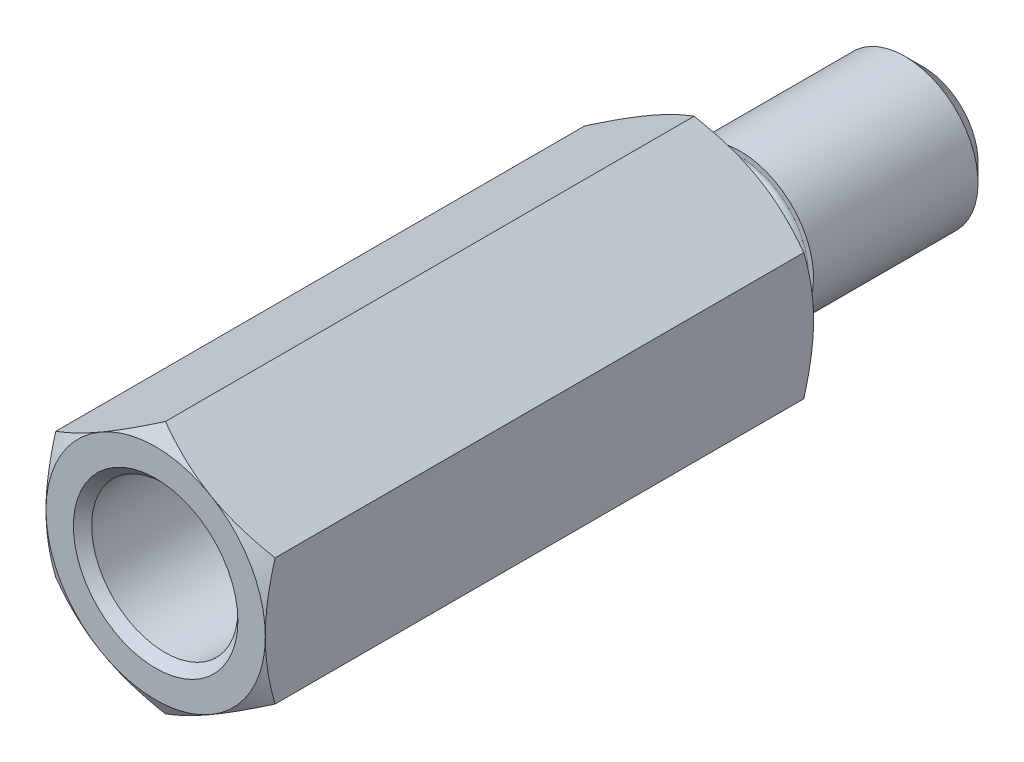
ISO-10303-21;
HEADER;
FILE_DESCRIPTION(('STEP AP214'),'2;1');
FILE_NAME('part.step','',(''),(''),'','','');
FILE_SCHEMA(('AUTOMOTIVE_DESIGN { 1 0 10303 214 1 1 1 1 }'));
ENDSEC;
DATA;
#1=APPLICATION_CONTEXT('core data for automotive mechanical design processes');
#2=APPLICATION_PROTOCOL_DEFINITION('international standard','automotive_design',2000,#1);
#3=PRODUCT_CONTEXT('',#1,'mechanical');
#4=PRODUCT('Part','Part','',(#3));
#5=PRODUCT_RELATED_PRODUCT_CATEGORY('part','',(#4));
#6=PRODUCT_DEFINITION_FORMATION('','',#4);
#7=PRODUCT_DEFINITION_CONTEXT('part definition',#1,'design');
#8=PRODUCT_DEFINITION('design','',#6,#7);
#9=PRODUCT_DEFINITION_SHAPE('','',#8);
#10=(LENGTH_UNIT() NAMED_UNIT(*) SI_UNIT(.MILLI.,.METRE.));
#11=(NAMED_UNIT(*) PLANE_ANGLE_UNIT() SI_UNIT($,.RADIAN.));
#12=(NAMED_UNIT(*) SI_UNIT($,.STERADIAN.) SOLID_ANGLE_UNIT());
#13=UNCERTAINTY_MEASURE_WITH_UNIT(LENGTH_MEASURE(1.E-05),#10,'distance_accuracy_value','');
#14=(GEOMETRIC_REPRESENTATION_CONTEXT(3) GLOBAL_UNCERTAINTY_ASSIGNED_CONTEXT((#13)) GLOBAL_UNIT_ASSIGNED_CONTEXT((#10,
#11,#12)) REPRESENTATION_CONTEXT('',''));
#15=CARTESIAN_POINT('',(0.,0.,0.));
#16=DIRECTION('',(0.,0.,1.));
#17=DIRECTION('',(1.,0.,0.));
#18=AXIS2_PLACEMENT_3D('',#15,#16,#17);
#19=CARTESIAN_POINT('',(0.,17.3205080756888,0.));
#20=DIRECTION('',(0.,0.,1.));
#21=DIRECTION('',(1.,0.,0.));
#22=AXIS2_PLACEMENT_3D('',#19,#20,#21);
#23=PLANE('',#22);
#24=CARTESIAN_POINT('',(0.,0.,0.));
#25=DIRECTION('',(0.,0.,1.));
#26=DIRECTION('',(1.,0.,0.));
#27=AXIS2_PLACEMENT_3D('',#24,#25,#26);
#28=CIRCLE('',#27,9.3);
#29=CARTESIAN_POINT('',(9.3,0.,0.));
#30=VERTEX_POINT('',#29);
#31=EDGE_CURVE('E283',#30,#30,#28,.T.);
#32=ORIENTED_EDGE('',*,*,#31,.T.);
#33=EDGE_LOOP('',(#32));
#34=FACE_BOUND('',#33,.T.);
#35=CARTESIAN_POINT('',(0.,0.,0.));
#36=DIRECTION('',(0.,0.,1.));
#37=DIRECTION('',(1.,0.,0.));
#38=AXIS2_PLACEMENT_3D('',#35,#36,#37);
#39=CIRCLE('',#38,15.);
#40=CARTESIAN_POINT('',(15.,0.,0.));
#41=VERTEX_POINT('',#40);
#42=CARTESIAN_POINT('',(7.5,12.9903810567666,0.));
#43=VERTEX_POINT('',#42);
#44=EDGE_CURVE('E107',#41,#43,#39,.T.);
#45=ORIENTED_EDGE('',*,*,#44,.F.);
#46=CARTESIAN_POINT('',(0.,0.,0.));
#47=DIRECTION('',(0.,0.,1.));
#48=DIRECTION('',(1.,0.,0.));
#49=AXIS2_PLACEMENT_3D('',#46,#47,#48);
#50=CIRCLE('',#49,15.);
#51=CARTESIAN_POINT('',(7.5,-12.9903810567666,0.));
#52=VERTEX_POINT('',#51);
#53=EDGE_CURVE('E18',#52,#41,#50,.T.);
#54=ORIENTED_EDGE('',*,*,#53,.F.);
#55=CARTESIAN_POINT('',(-7.5,-12.9903810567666,0.));
#56=VERTEX_POINT('',#55);
#57=EDGE_CURVE('E125',#56,#52,#50,.T.);
#58=ORIENTED_EDGE('',*,*,#57,.F.);
#59=CARTESIAN_POINT('',(-15.,0.,0.));
#60=VERTEX_POINT('',#59);
#61=EDGE_CURVE('E590',#60,#56,#50,.T.);
#62=ORIENTED_EDGE('',*,*,#61,.F.);
#63=CARTESIAN_POINT('',(-7.5,12.9903810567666,0.));
#64=VERTEX_POINT('',#63);
#65=EDGE_CURVE('E23',#64,#60,#50,.T.);
#66=ORIENTED_EDGE('',*,*,#65,.F.);
#67=EDGE_CURVE('E9',#43,#64,#50,.T.);
#68=ORIENTED_EDGE('',*,*,#67,.F.);
#69=EDGE_LOOP('',(#45,#54,#58,#62,#66,#68));
#70=FACE_BOUND('',#69,.T.);
#71=ADVANCED_FACE('F14',(#34,#70),#23,.F.);
#72=CARTESIAN_POINT('',(0.,0.,-30.));
#73=DIRECTION('',(0.,0.,-1.));
#74=DIRECTION('',(0.,1.,0.));
#75=AXIS2_PLACEMENT_3D('',#72,#73,#74);
#76=CYLINDRICAL_SURFACE('',#75,8.5);
#77=CARTESIAN_POINT('',(0.,0.,-4.2));
#78=DIRECTION('',(0.,0.,1.));
#79=DIRECTION('',(0.,-1.,0.));
#80=AXIS2_PLACEMENT_3D('',#77,#78,#79);
#81=CIRCLE('',#80,8.5);
#82=CARTESIAN_POINT('',(0.,-8.5,-4.2));
#83=VERTEX_POINT('',#82);
#84=EDGE_CURVE('E280',#83,#83,#81,.T.);
#85=ORIENTED_EDGE('',*,*,#84,.T.);
#86=EDGE_LOOP('',(#85));
#87=FACE_BOUND('',#86,.T.);
#88=CARTESIAN_POINT('',(0.,0.,-0.8));
#89=DIRECTION('',(0.,0.,1.));
#90=DIRECTION('',(1.,0.,0.));
#91=AXIS2_PLACEMENT_3D('',#88,#89,#90);
#92=CIRCLE('',#91,8.5);
#93=CARTESIAN_POINT('',(8.5,0.,-0.8));
#94=VERTEX_POINT('',#93);
#95=EDGE_CURVE('E277',#94,#94,#92,.F.);
#96=ORIENTED_EDGE('',*,*,#95,.T.);
#97=EDGE_LOOP('',(#96));
#98=FACE_BOUND('',#97,.T.);
#99=ADVANCED_FACE('F337',(#87,#98),#76,.T.);
#100=CARTESIAN_POINT('',(0.,8.5,-5.));
#101=DIRECTION('',(0.,0.,1.));
#102=DIRECTION('',(0.,-1.,0.));
#103=AXIS2_PLACEMENT_3D('',#100,#101,#102);
#104=PLANE('',#103);
#105=CARTESIAN_POINT('',(0.,0.,-5.));
#106=DIRECTION('',(0.,0.,1.));
#107=DIRECTION('',(0.,-1.,0.));
#108=AXIS2_PLACEMENT_3D('',#105,#106,#107);
#109=CIRCLE('',#108,9.3);
#110=CARTESIAN_POINT('',(0.,-9.3,-5.));
#111=VERTEX_POINT('',#110);
#112=EDGE_CURVE('E274',#111,#111,#109,.F.);
#113=ORIENTED_EDGE('',*,*,#112,.T.);
#114=EDGE_LOOP('',(#113));
#115=FACE_BOUND('',#114,.T.);
#116=CARTESIAN_POINT('',(0.,0.,-5.));
#117=DIRECTION('',(0.,0.,-1.));
#118=DIRECTION('',(0.,1.,0.));
#119=AXIS2_PLACEMENT_3D('',#116,#117,#118);
#120=CIRCLE('',#119,10.);
#121=CARTESIAN_POINT('',(0.,10.,-5.));
#122=VERTEX_POINT('',#121);
#123=EDGE_CURVE('E295',#122,#122,#120,.T.);
#124=ORIENTED_EDGE('',*,*,#123,.F.);
#125=EDGE_LOOP('',(#124));
#126=FACE_BOUND('',#125,.T.);
#127=ADVANCED_FACE('F342',(#115,#126),#104,.T.);
#128=CARTESIAN_POINT('',(0.,0.,-30.));
#129=DIRECTION('',(0.,0.,-1.));
#130=DIRECTION('',(0.,1.,0.));
#131=AXIS2_PLACEMENT_3D('',#128,#129,#130);
#132=CYLINDRICAL_SURFACE('',#131,10.);
#133=ORIENTED_EDGE('',*,*,#123,.T.);
#134=EDGE_LOOP('',(#133));
#135=FACE_BOUND('',#134,.T.);
#136=CARTESIAN_POINT('',(0.,0.,-27.5));
#137=DIRECTION('',(0.,0.,-1.));
#138=DIRECTION('',(0.,1.,0.));
#139=AXIS2_PLACEMENT_3D('',#136,#137,#138);
#140=CIRCLE('',#139,10.);
#141=CARTESIAN_POINT('',(0.,10.,-27.5));
#142=VERTEX_POINT('',#141);
#143=EDGE_CURVE('E300',#142,#142,#140,.T.);
#144=ORIENTED_EDGE('',*,*,#143,.F.);
#145=EDGE_LOOP('',(#144));
#146=FACE_BOUND('',#145,.T.);
#147=ADVANCED_FACE('F352',(#135,#146),#132,.T.);
#148=CARTESIAN_POINT('',(0.,0.,-30.));
#149=DIRECTION('',(0.,0.,1.));
#150=DIRECTION('',(0.,-1.,0.));
#151=AXIS2_PLACEMENT_3D('',#148,#149,#150);
#152=CONICAL_SURFACE('',#151,7.5,0.78539816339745);
#153=ORIENTED_EDGE('',*,*,#143,.T.);
#154=EDGE_LOOP('',(#153));
#155=FACE_BOUND('',#154,.T.);
#156=CARTESIAN_POINT('',(0.,0.,-30.));
#157=DIRECTION('',(0.,0.,-1.));
#158=DIRECTION('',(0.,1.,0.));
#159=AXIS2_PLACEMENT_3D('',#156,#157,#158);
#160=CIRCLE('',#159,7.5);
#161=CARTESIAN_POINT('',(0.,7.5,-30.));
#162=VERTEX_POINT('',#161);
#163=EDGE_CURVE('E303',#162,#162,#160,.T.);
#164=ORIENTED_EDGE('',*,*,#163,.F.);
#165=EDGE_LOOP('',(#164));
#166=FACE_BOUND('',#165,.T.);
#167=ADVANCED_FACE('F331',(#155,#166),#152,.T.);
#168=CARTESIAN_POINT('',(0.,7.5,-30.));
#169=DIRECTION('',(0.,0.,-1.));
#170=DIRECTION('',(0.,1.,0.));
#171=AXIS2_PLACEMENT_3D('',#168,#169,#170);
#172=PLANE('',#171);
#173=ORIENTED_EDGE('',*,*,#163,.T.);
#174=EDGE_LOOP('',(#173));
#175=FACE_BOUND('',#174,.T.);
#176=ADVANCED_FACE('F323',(#175),#172,.T.);
#177=CARTESIAN_POINT('',(0.,0.,-4.2));
#178=DIRECTION('',(0.,0.,1.));
#179=DIRECTION('',(0.,-1.,0.));
#180=AXIS2_PLACEMENT_3D('',#177,#178,#179);
#181=TOROIDAL_SURFACE('',#180,9.3,0.8);
#182=ORIENTED_EDGE('',*,*,#84,.F.);
#183=EDGE_LOOP('',(#182));
#184=FACE_BOUND('',#183,.T.);
#185=ORIENTED_EDGE('',*,*,#112,.F.);
#186=EDGE_LOOP('',(#185));
#187=FACE_BOUND('',#186,.T.);
#188=ADVANCED_FACE('F320',(#184,#187),#181,.F.);
#189=CARTESIAN_POINT('',(0.,0.,-0.8));
#190=DIRECTION('',(0.,0.,1.));
#191=DIRECTION('',(1.,0.,0.));
#192=AXIS2_PLACEMENT_3D('',#189,#190,#191);
#193=TOROIDAL_SURFACE('',#192,9.3,0.8);
#194=ORIENTED_EDGE('',*,*,#31,.F.);
#195=EDGE_LOOP('',(#194));
#196=FACE_BOUND('',#195,.T.);
#197=ORIENTED_EDGE('',*,*,#95,.F.);
#198=EDGE_LOOP('',(#197));
#199=FACE_BOUND('',#198,.T.);
#200=ADVANCED_FACE('F16',(#196,#199),#193,.F.);
#201=CARTESIAN_POINT('',(0.,0.,4.5528708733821));
#202=DIRECTION('',(0.,0.,1.));
#203=DIRECTION('',(1.,0.,0.));
#204=AXIS2_PLACEMENT_3D('',#201,#202,#203);
#205=CONICAL_SURFACE('',#204,22.8858036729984,1.0471975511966);
#206=CARTESIAN_POINT('',(15.,-23.4169378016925,7.39540930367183));
#207=CARTESIAN_POINT('',(15.,-23.0887275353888,7.2358492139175));
#208=CARTESIAN_POINT('',(15.,-22.7601362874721,7.07707316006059));
#209=CARTESIAN_POINT('',(15.,-22.1021123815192,6.76126638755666));
#210=CARTESIAN_POINT('',(15.,-21.7726797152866,6.60423568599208));
#211=CARTESIAN_POINT('',(15.,-20.7829148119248,6.1359871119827));
#212=CARTESIAN_POINT('',(15.,-20.1212103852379,5.82765894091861));
#213=CARTESIAN_POINT('',(15.,-18.7898971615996,5.21891652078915));
#214=CARTESIAN_POINT('',(15.,-18.1202650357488,4.91855317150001));
#215=CARTESIAN_POINT('',(15.,-16.7757294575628,4.32990832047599));
#216=CARTESIAN_POINT('',(15.,-16.1008262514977,4.04162625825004));
#217=CARTESIAN_POINT('',(15.,-14.7222699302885,3.47106254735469));
#218=CARTESIAN_POINT('',(15.,-14.0184035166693,3.18929360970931));
#219=CARTESIAN_POINT('',(15.,-12.6024881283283,2.64670835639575));
#220=CARTESIAN_POINT('',(15.,-11.8904382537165,2.38589437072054));
#221=CARTESIAN_POINT('',(15.,-10.4583296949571,1.89195727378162));
#222=CARTESIAN_POINT('',(15.,-9.73829004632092,1.65877940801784));
#223=CARTESIAN_POINT('',(15.,-8.28781503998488,1.22748088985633));
#224=CARTESIAN_POINT('',(15.,-7.55738298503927,1.02934935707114));
#225=CARTESIAN_POINT('',(15.,-6.45583778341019,0.766075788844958));
#226=CARTESIAN_POINT('',(15.,-6.08871159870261,0.68415470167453));
#227=CARTESIAN_POINT('',(15.,-5.35192234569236,0.532579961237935));
#228=CARTESIAN_POINT('',(15.,-4.98225932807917,0.46292606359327));
#229=CARTESIAN_POINT('',(15.,-4.2406392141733,0.337105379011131));
#230=CARTESIAN_POINT('',(15.,-3.86868215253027,0.280938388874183));
#231=CARTESIAN_POINT('',(15.,-3.12285776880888,0.18320638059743));
#232=CARTESIAN_POINT('',(15.,-2.74899053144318,0.14164072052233));
#233=CARTESIAN_POINT('',(15.,-2.0048141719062,0.0744665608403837));
#234=CARTESIAN_POINT('',(15.,-1.63452360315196,0.0486537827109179));
#235=CARTESIAN_POINT('',(15.,-0.893182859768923,0.0127185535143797));
#236=CARTESIAN_POINT('',(15.,-0.522132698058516,0.00259583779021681));
#237=CARTESIAN_POINT('',(15.,0.22006349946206,-0.00171784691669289));
#238=CARTESIAN_POINT('',(15.,0.591209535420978,0.00409120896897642));
#239=CARTESIAN_POINT('',(15.,1.33292255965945,0.0314974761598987));
#240=CARTESIAN_POINT('',(15.,1.70348952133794,0.053095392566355));
#241=CARTESIAN_POINT('',(15.,2.58944494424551,0.123144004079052));
#242=CARTESIAN_POINT('',(15.,3.10427185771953,0.17882830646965));
#243=CARTESIAN_POINT('',(15.,4.13020898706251,0.317675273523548));
#244=CARTESIAN_POINT('',(15.,4.64131870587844,0.400841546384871));
#245=CARTESIAN_POINT('',(15.,5.65929886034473,0.591694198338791));
#246=CARTESIAN_POINT('',(15.,6.16616576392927,0.699399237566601));
#247=CARTESIAN_POINT('',(15.,7.17486640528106,0.936034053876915));
#248=CARTESIAN_POINT('',(15.,7.67670021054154,1.06496354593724));
#249=CARTESIAN_POINT('',(15.,8.68646163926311,1.34397310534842));
#250=CARTESIAN_POINT('',(15.,9.19427596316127,1.49446036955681));
#251=CARTESIAN_POINT('',(15.,10.2049044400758,1.81129475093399));
#252=CARTESIAN_POINT('',(15.,10.7077185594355,1.97764197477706));
#253=CARTESIAN_POINT('',(15.,11.7085896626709,2.32352791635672));
#254=CARTESIAN_POINT('',(15.,12.2066480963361,2.5030624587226));
#255=CARTESIAN_POINT('',(15.,13.1986173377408,2.87318042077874));
#256=CARTESIAN_POINT('',(15.,13.6925281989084,3.06376369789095));
#257=CARTESIAN_POINT('',(15.,14.8763030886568,3.53334276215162));
#258=CARTESIAN_POINT('',(15.,15.5643784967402,3.81684125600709));
#259=CARTESIAN_POINT('',(15.,16.9344989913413,4.39809686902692));
#260=CARTESIAN_POINT('',(15.,17.6165436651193,4.69585495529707));
#261=CARTESIAN_POINT('',(15.,18.9757536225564,5.30271589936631));
#262=CARTESIAN_POINT('',(15.,19.6529176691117,5.61182152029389));
#263=CARTESIAN_POINT('',(15.,21.003031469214,6.23903878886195));
#264=CARTESIAN_POINT('',(15.,21.6759813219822,6.55715022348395));
#265=CARTESIAN_POINT('',(15.,23.019166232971,7.2010386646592));
#266=CARTESIAN_POINT('',(15.,23.6893971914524,7.52682420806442));
#267=CARTESIAN_POINT('',(15.,25.026922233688,8.18436854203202));
#268=CARTESIAN_POINT('',(15.,25.694216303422,8.51612736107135));
#269=CARTESIAN_POINT('',(15.,27.0262353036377,9.18452967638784));
#270=CARTESIAN_POINT('',(15.,27.6909605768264,9.52117249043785));
#271=CARTESIAN_POINT('',(15.,29.0183074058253,10.1985726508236));
#272=CARTESIAN_POINT('',(15.,29.6809289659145,10.5393299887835));
#273=CARTESIAN_POINT('',(15.,31.551520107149,11.5074627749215));
#274=CARTESIAN_POINT('',(15.,32.7574045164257,12.1388669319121));
#275=CARTESIAN_POINT('',(15.,35.1646980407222,13.4102413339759));
#276=CARTESIAN_POINT('',(15.,36.3661069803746,14.0502119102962));
#277=CARTESIAN_POINT('',(15.,38.7622527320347,15.334991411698));
#278=CARTESIAN_POINT('',(15.,39.9569987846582,15.9797831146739));
#279=CARTESIAN_POINT('',(15.,41.7470159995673,16.9507579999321));
#280=CARTESIAN_POINT('',(15.,42.3433209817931,17.2750381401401));
#281=CARTESIAN_POINT('',(15.,43.5353109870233,17.9247337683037));
#282=CARTESIAN_POINT('',(15.,44.1309960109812,18.2501492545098));
#283=CARTESIAN_POINT('',(15.,44.7264065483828,18.5760663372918));
#284=B_SPLINE_CURVE_WITH_KNOTS('',3,(#206,#207,#208,#209,#210,#211,#212,#213,#214,#215,#216,
#217,#218,#219,#220,#221,#222,#223,#224,#225,#226,#227,#228,#229,#230,#231,#232,#233,#234,#235,
#236,#237,#238,#239,#240,#241,#242,#243,#244,#245,#246,#247,#248,#249,#250,#251,#252,#253,#254,
#255,#256,#257,#258,#259,#260,#261,#262,#263,#264,#265,#266,#267,#268,#269,#270,#271,#272,#273,
#274,#275,#276,#277,#278,#279,#280,#281,#282,#283),.UNSPECIFIED.,.F.,.F.,(4,2,2,2,2,2,2,2,2,2,2,
2,2,2,2,2,2,2,2,2,2,2,2,2,2,2,2,2,2,2,2,2,2,2,2,2,2,2,4),(0.,1.09481887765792,2.18964846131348,
4.37962371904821,6.58126358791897,8.7828012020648,11.0570562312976,13.3315637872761,
15.6014868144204,17.8707038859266,18.9989975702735,20.1272687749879,21.2555229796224,
22.3837275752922,23.4969725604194,24.6101987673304,25.7234267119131,26.8367043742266,
28.3893375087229,29.9421745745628,31.4961964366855,33.0501974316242,34.6388177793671,
36.2274488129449,37.8155790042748,39.403688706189,41.6360386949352,43.8685402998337,
46.1015891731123,48.334585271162,50.5701951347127,52.8058156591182,55.0411268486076,
57.2764334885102,61.3599403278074,65.4436055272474,69.5164955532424,71.5528234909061,
73.5891482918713),.UNSPECIFIED.);
#285=CARTESIAN_POINT('',(15.,-8.66025403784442,1.3397459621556));
#286=VERTEX_POINT('',#285);
#287=EDGE_CURVE('E115',#41,#286,#284,.F.);
#288=ORIENTED_EDGE('',*,*,#287,.T.);
#289=CARTESIAN_POINT('',(15.0002,-8.66013856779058,1.33981262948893));
#290=CARTESIAN_POINT('',(14.6705058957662,-8.85048754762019,1.22992178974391));
#291=CARTESIAN_POINT('',(14.3395258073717,-9.04157899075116,1.12501758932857));
#292=CARTESIAN_POINT('',(13.674911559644,-9.42529420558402,0.92656858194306));
#293=CARTESIAN_POINT('',(13.3412765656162,-9.61791845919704,0.833027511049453));
#294=CARTESIAN_POINT('',(12.6707077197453,-10.0050715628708,0.658562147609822));
#295=CARTESIAN_POINT('',(12.333767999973,-10.199603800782,0.57766770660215));
#296=CARTESIAN_POINT('',(11.6575472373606,-10.5900200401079,0.430232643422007));
#297=CARTESIAN_POINT('',(11.3182663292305,-10.7859039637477,0.363691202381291));
#298=CARTESIAN_POINT('',(10.6460568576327,-11.1740042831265,0.247792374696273));
#299=CARTESIAN_POINT('',(10.3131781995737,-11.3661918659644,0.19805138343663));
#300=CARTESIAN_POINT('',(9.64589556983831,-11.7514476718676,0.114646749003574));
#301=CARTESIAN_POINT('',(9.31149156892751,-11.9445159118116,0.0809834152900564));
#302=CARTESIAN_POINT('',(8.64212181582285,-12.3309767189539,0.0305840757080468));
#303=CARTESIAN_POINT('',(8.30715720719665,-12.5243686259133,0.013827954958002));
#304=CARTESIAN_POINT('',(7.636918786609,-12.9113309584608,-0.00239660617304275));
#305=CARTESIAN_POINT('',(7.30164498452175,-13.1049013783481,-0.00186558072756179));
#306=CARTESIAN_POINT('',(6.67485311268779,-13.4667798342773,0.0152766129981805));
#307=CARTESIAN_POINT('',(6.38329037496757,-13.6351136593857,0.0297968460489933));
#308=CARTESIAN_POINT('',(5.80083556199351,-13.9713941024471,0.0716371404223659));
#309=CARTESIAN_POINT('',(5.5099435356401,-14.1393406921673,0.0989581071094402));
#310=CARTESIAN_POINT('',(4.92898814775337,-14.4747554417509,0.165923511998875));
#311=CARTESIAN_POINT('',(4.63892567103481,-14.6422230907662,0.20557812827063));
#312=CARTESIAN_POINT('',(4.06016058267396,-14.9763732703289,0.29651510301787));
#313=CARTESIAN_POINT('',(3.77145806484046,-15.1430557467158,0.347798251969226));
#314=CARTESIAN_POINT('',(2.89508556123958,-15.6490296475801,0.520386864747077));
#315=CARTESIAN_POINT('',(2.30995340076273,-15.9868558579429,0.658901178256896));
#316=CARTESIAN_POINT('',(1.14841408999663,-16.6574708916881,0.973271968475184));
#317=CARTESIAN_POINT('',(0.571992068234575,-16.9902683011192,1.14905461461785));
#318=CARTESIAN_POINT('',(-0.000200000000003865,-17.3206235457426,1.33981262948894));
#319=B_SPLINE_CURVE_WITH_KNOTS('',3,(#289,#290,#291,#292,#293,#294,#295,#296,#297,#298,#299,
#300,#301,#302,#303,#304,#305,#306,#307,#308,#309,#310,#311,#312,#313,#314,#315,#316,#317,#318),
.UNSPECIFIED.,.F.,.F.,(4,2,2,2,2,2,2,2,2,2,2,2,2,2,4),(0.,1.18875411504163,2.37789802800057,
3.56980778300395,4.76164951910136,5.92407379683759,7.08652044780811,8.24758247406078,
9.40860862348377,10.4193068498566,11.4300765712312,12.4416826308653,13.4533574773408,
15.5211962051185,17.5849760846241),.UNSPECIFIED.);
#320=EDGE_CURVE('E122',#286,#52,#319,.T.);
#321=ORIENTED_EDGE('',*,*,#320,.T.);
#322=ORIENTED_EDGE('',*,*,#53,.T.);
#323=EDGE_LOOP('',(#288,#321,#322));
#324=FACE_BOUND('',#323,.T.);
#325=ADVANCED_FACE('F120',(#324),#205,.T.);
#326=CARTESIAN_POINT('',(0.,-17.3205080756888,1.33974596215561));
#327=VERTEX_POINT('',#326);
#328=EDGE_CURVE('E135',#52,#327,#319,.T.);
#329=ORIENTED_EDGE('',*,*,#328,.T.);
#330=CARTESIAN_POINT('',(0.000199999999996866,-17.3206235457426,1.33981262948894));
#331=CARTESIAN_POINT('',(-0.329494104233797,-17.130274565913,1.22992178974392));
#332=CARTESIAN_POINT('',(-0.660474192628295,-16.9391831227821,1.12501758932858));
#333=CARTESIAN_POINT('',(-1.32508844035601,-16.5554679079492,0.926568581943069));
#334=CARTESIAN_POINT('',(-1.6587234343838,-16.3628436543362,0.833027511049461));
#335=CARTESIAN_POINT('',(-2.32929228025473,-15.9756905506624,0.658562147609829));
#336=CARTESIAN_POINT('',(-2.66623200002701,-15.7811583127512,0.577667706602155));
#337=CARTESIAN_POINT('',(-3.34245276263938,-15.3907420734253,0.430232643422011));
#338=CARTESIAN_POINT('',(-3.68173367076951,-15.1948581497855,0.363691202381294));
#339=CARTESIAN_POINT('',(-4.35394314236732,-14.8067578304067,0.247792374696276));
#340=CARTESIAN_POINT('',(-4.68682180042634,-14.6145702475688,0.198051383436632));
#341=CARTESIAN_POINT('',(-5.3541044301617,-14.2293144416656,0.114646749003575));
#342=CARTESIAN_POINT('',(-5.6885084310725,-14.0362462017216,0.0809834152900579));
#343=CARTESIAN_POINT('',(-6.35787818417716,-13.6497853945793,0.0305840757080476));
#344=CARTESIAN_POINT('',(-6.69284279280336,-13.4563934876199,0.0138279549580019));
#345=CARTESIAN_POINT('',(-7.36308121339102,-13.0694311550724,-0.00239660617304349));
#346=CARTESIAN_POINT('',(-7.69835501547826,-12.8758607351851,-0.00186558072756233));
#347=CARTESIAN_POINT('',(-8.32514688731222,-12.5139822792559,0.0152766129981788));
#348=CARTESIAN_POINT('',(-8.61670962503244,-12.3456484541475,0.0297968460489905));
#349=CARTESIAN_POINT('',(-9.1991644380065,-12.0093680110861,0.0716371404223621));
#350=CARTESIAN_POINT('',(-9.4900564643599,-11.8414214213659,0.0989581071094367));
#351=CARTESIAN_POINT('',(-10.0710118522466,-11.5060066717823,0.165923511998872));
#352=CARTESIAN_POINT('',(-10.3610743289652,-11.338539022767,0.205578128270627));
#353=CARTESIAN_POINT('',(-10.9398394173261,-11.0043888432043,0.296515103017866));
#354=CARTESIAN_POINT('',(-11.2285419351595,-10.8377063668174,0.347798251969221));
#355=CARTESIAN_POINT('',(-12.1049144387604,-10.3317324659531,0.52038686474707));
#356=CARTESIAN_POINT('',(-12.6900465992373,-9.99390625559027,0.65890117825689));
#357=CARTESIAN_POINT('',(-13.8515859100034,-9.32329122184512,0.973271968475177));
#358=CARTESIAN_POINT('',(-14.4280079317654,-8.99049381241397,1.14905461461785));
#359=CARTESIAN_POINT('',(-15.0002,-8.66013856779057,1.33981262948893));
#360=B_SPLINE_CURVE_WITH_KNOTS('',3,(#330,#331,#332,#333,#334,#335,#336,#337,#338,#339,#340,
#341,#342,#343,#344,#345,#346,#347,#348,#349,#350,#351,#352,#353,#354,#355,#356,#357,#358,#359),
.UNSPECIFIED.,.F.,.F.,(4,2,2,2,2,2,2,2,2,2,2,2,2,2,4),(0.,1.18875411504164,2.37789802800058,
3.56980778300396,4.76164951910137,5.9240737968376,7.08652044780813,8.2475824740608,
9.40860862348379,10.4193068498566,11.4300765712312,12.4416826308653,13.4533574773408,
15.5211962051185,17.5849760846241),.UNSPECIFIED.);
#361=EDGE_CURVE('E598',#327,#56,#360,.T.);
#362=ORIENTED_EDGE('',*,*,#361,.T.);
#363=ORIENTED_EDGE('',*,*,#57,.T.);
#364=EDGE_LOOP('',(#329,#362,#363));
#365=FACE_BOUND('',#364,.T.);
#366=ADVANCED_FACE('F424',(#365),#205,.T.);
#367=CARTESIAN_POINT('',(-15.,-23.4169377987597,7.39540930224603));
#368=CARTESIAN_POINT('',(-15.,-23.0887275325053,7.23584921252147));
#369=CARTESIAN_POINT('',(-15.,-22.7601362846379,7.07707315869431));
#370=CARTESIAN_POINT('',(-15.,-22.1021123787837,6.76126638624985));
#371=CARTESIAN_POINT('',(-15.,-21.7726797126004,6.60423568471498));
#372=CARTESIAN_POINT('',(-15.,-20.7829148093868,6.13598711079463));
#373=CARTESIAN_POINT('',(-15.,-20.1212103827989,5.82765893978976));
#374=CARTESIAN_POINT('',(-15.,-18.78989715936,5.21891651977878));
#375=CARTESIAN_POINT('',(-15.,-18.1202650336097,4.91855317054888));
#376=CARTESIAN_POINT('',(-15.,-16.7757294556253,4.32990831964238));
#377=CARTESIAN_POINT('',(-15.,-16.1008262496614,4.04162625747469));
#378=CARTESIAN_POINT('',(-15.,-14.7222699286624,3.47106254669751));
#379=CARTESIAN_POINT('',(-15.,-14.0184035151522,3.18929360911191));
#380=CARTESIAN_POINT('',(-15.,-12.6024881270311,2.6467083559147));
#381=CARTESIAN_POINT('',(-15.,-11.8904382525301,2.38589437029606));
#382=CARTESIAN_POINT('',(-15.,-10.4583296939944,1.89195727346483));
#383=CARTESIAN_POINT('',(-15.,-9.73829004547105,1.65877940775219));
#384=CARTESIAN_POINT('',(-15.,-8.28781503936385,1.22748088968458));
#385=CARTESIAN_POINT('',(-15.,-7.55738298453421,1.02934935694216));
#386=CARTESIAN_POINT('',(-15.,-6.45583778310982,0.766075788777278));
#387=CARTESIAN_POINT('',(-15.,-6.08871159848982,0.684154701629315));
#388=CARTESIAN_POINT('',(-15.,-5.35192234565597,0.532579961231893));
#389=CARTESIAN_POINT('',(-15.,-4.98225932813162,0.462926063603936));
#390=CARTESIAN_POINT('',(-15.,-4.24063921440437,0.337105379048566));
#391=CARTESIAN_POINT('',(-15.,-3.86868215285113,0.280938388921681));
#392=CARTESIAN_POINT('',(-15.,-3.12285776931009,0.18320638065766));
#393=CARTESIAN_POINT('',(-15.,-2.74899053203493,0.141640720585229));
#394=CARTESIAN_POINT('',(-15.,-2.00481417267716,0.0744665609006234));
#395=CARTESIAN_POINT('',(-15.,-1.63452360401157,0.0486537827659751));
#396=CARTESIAN_POINT('',(-15.,-0.893182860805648,0.0127185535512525));
#397=CARTESIAN_POINT('',(-15.,-0.522132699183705,0.00259583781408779));
#398=CARTESIAN_POINT('',(-15.,0.220063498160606,-0.00171784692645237));
#399=CARTESIAN_POINT('',(-15.,0.591209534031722,0.00409120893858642));
#400=CARTESIAN_POINT('',(-15.,1.33292255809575,0.0314974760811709));
#401=CARTESIAN_POINT('',(-15.,1.70348951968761,0.0530953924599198));
#402=CARTESIAN_POINT('',(-15.,2.58944494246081,0.123144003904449));
#403=CARTESIAN_POINT('',(-15.,3.10427185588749,0.17882830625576));
#404=CARTESIAN_POINT('',(-15.,4.13020898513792,0.317675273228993));
#405=CARTESIAN_POINT('',(-15.,4.64131870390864,0.400841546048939));
#406=CARTESIAN_POINT('',(-15.,5.65929885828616,0.591694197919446));
#407=CARTESIAN_POINT('',(-15.,6.16616576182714,0.699399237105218));
#408=CARTESIAN_POINT('',(-15.,7.17486640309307,0.936034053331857));
#409=CARTESIAN_POINT('',(-15.,7.67670020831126,1.06496354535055));
#410=CARTESIAN_POINT('',(-15.,8.6864616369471,1.34397310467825));
#411=CARTESIAN_POINT('',(-15.,9.19427596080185,1.4944603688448));
#412=CARTESIAN_POINT('',(-15.,10.20490443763,1.81129475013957));
#413=CARTESIAN_POINT('',(-15.,10.7077185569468,1.97764197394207));
#414=CARTESIAN_POINT('',(-15.,11.7085896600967,2.32352791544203));
#415=CARTESIAN_POINT('',(-15.,12.2066480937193,2.50306245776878));
#416=CARTESIAN_POINT('',(-15.,13.1986173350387,2.87318041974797));
#417=CARTESIAN_POINT('',(-15.,13.6925281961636,3.06376369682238));
#418=CARTESIAN_POINT('',(-15.,14.8763030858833,3.53334276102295));
#419=CARTESIAN_POINT('',(-15.,15.5643784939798,3.81684125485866));
#420=CARTESIAN_POINT('',(-15.,16.9344989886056,4.39809686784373));
#421=CARTESIAN_POINT('',(-15.,17.6165436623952,4.69585495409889));
#422=CARTESIAN_POINT('',(-15.,18.9757536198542,5.30271589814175));
#423=CARTESIAN_POINT('',(-15.,19.6529176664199,5.61182151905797));
#424=CARTESIAN_POINT('',(-15.,21.0030314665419,6.23903878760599));
#425=CARTESIAN_POINT('',(-15.,21.6759813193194,6.55715022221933));
#426=CARTESIAN_POINT('',(-15.,23.0191662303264,7.20103866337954));
#427=CARTESIAN_POINT('',(-15.,23.6893971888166,7.52682420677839));
#428=CARTESIAN_POINT('',(-15.,25.0269222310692,8.18436854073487));
#429=CARTESIAN_POINT('',(-15.,25.6942163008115,8.51612735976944));
#430=CARTESIAN_POINT('',(-15.,27.0262353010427,9.18452967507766));
#431=CARTESIAN_POINT('',(-15.,27.690960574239,9.52117248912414));
#432=CARTESIAN_POINT('',(-15.,29.0183074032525,10.1985726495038));
#433=CARTESIAN_POINT('',(-15.,29.6809289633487,10.5393299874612));
#434=CARTESIAN_POINT('',(-15.,31.5515201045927,11.507462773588));
#435=CARTESIAN_POINT('',(-15.,32.7574045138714,12.1388669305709));
#436=CARTESIAN_POINT('',(-15.,35.1646980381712,13.4102413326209));
#437=CARTESIAN_POINT('',(-15.,36.3661069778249,14.050211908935));
#438=CARTESIAN_POINT('',(-15.,38.762252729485,15.3349914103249));
#439=CARTESIAN_POINT('',(-15.,39.9569987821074,15.9797831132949));
#440=CARTESIAN_POINT('',(-15.,41.7470159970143,16.950757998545));
#441=CARTESIAN_POINT('',(-15.,42.3433209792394,17.2750381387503));
#442=CARTESIAN_POINT('',(-15.,43.535310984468,17.9247337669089));
#443=CARTESIAN_POINT('',(-15.,44.1309960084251,18.2501492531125));
#444=CARTESIAN_POINT('',(-15.,44.7264065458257,18.5760663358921));
#445=B_SPLINE_CURVE_WITH_KNOTS('',3,(#367,#368,#369,#370,#371,#372,#373,#374,#375,#376,#377,
#378,#379,#380,#381,#382,#383,#384,#385,#386,#387,#388,#389,#390,#391,#392,#393,#394,#395,#396,
#397,#398,#399,#400,#401,#402,#403,#404,#405,#406,#407,#408,#409,#410,#411,#412,#413,#414,#415,
#416,#417,#418,#419,#420,#421,#422,#423,#424,#425,#426,#427,#428,#429,#430,#431,#432,#433,#434,
#435,#436,#437,#438,#439,#440,#441,#442,#443,#444),.UNSPECIFIED.,.F.,.F.,(4,2,2,2,2,2,2,2,2,2,2,
2,2,2,2,2,2,2,2,2,2,2,2,2,2,2,2,2,2,2,2,2,2,2,2,2,2,2,4),(0.,1.09481887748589,2.18964846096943,
4.37962371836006,6.58126358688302,8.78280120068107,11.0570562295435,13.3315637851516,
15.6014868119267,17.870703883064,18.9989975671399,20.1272687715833,21.2555229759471,
22.3837275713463,23.4969725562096,24.6101987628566,25.7234267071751,26.8367043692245,
28.3893375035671,29.9421745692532,31.4961964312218,33.0501974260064,34.6388177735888,
36.227448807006,37.8155789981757,39.4036886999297,41.6360386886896,43.8685402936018,
46.1015891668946,48.3345852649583,50.5701951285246,52.8058156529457,55.0411268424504,
57.2764334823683,61.3599403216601,65.4436055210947,69.5164955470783,71.5528234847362,
73.5891482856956),.UNSPECIFIED.);
#446=CARTESIAN_POINT('',(-15.,-8.66025403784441,1.3397459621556));
#447=VERTEX_POINT('',#446);
#448=EDGE_CURVE('E260',#447,#60,#445,.T.);
#449=ORIENTED_EDGE('',*,*,#448,.T.);
#450=ORIENTED_EDGE('',*,*,#61,.T.);
#451=EDGE_CURVE('E128',#56,#447,#360,.T.);
#452=ORIENTED_EDGE('',*,*,#451,.T.);
#453=EDGE_LOOP('',(#449,#450,#452));
#454=FACE_BOUND('',#453,.T.);
#455=ADVANCED_FACE('F156',(#454),#205,.T.);
#456=CARTESIAN_POINT('',(-15.,8.66025403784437,1.33974596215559));
#457=VERTEX_POINT('',#456);
#458=EDGE_CURVE('E576',#60,#457,#445,.T.);
#459=ORIENTED_EDGE('',*,*,#458,.T.);
#460=CARTESIAN_POINT('',(-15.0002,8.66013856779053,1.33981262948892));
#461=CARTESIAN_POINT('',(-14.6705058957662,8.85048754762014,1.2299217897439));
#462=CARTESIAN_POINT('',(-14.3395258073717,9.04157899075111,1.12501758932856));
#463=CARTESIAN_POINT('',(-13.674911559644,9.42529420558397,0.926568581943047));
#464=CARTESIAN_POINT('',(-13.3412765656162,9.61791845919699,0.833027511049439));
#465=CARTESIAN_POINT('',(-12.6707077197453,10.0050715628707,0.658562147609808));
#466=CARTESIAN_POINT('',(-12.333767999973,10.199603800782,0.577667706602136));
#467=CARTESIAN_POINT('',(-11.6575472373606,10.5900200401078,0.430232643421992));
#468=CARTESIAN_POINT('',(-11.3182663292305,10.7859039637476,0.363691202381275));
#469=CARTESIAN_POINT('',(-10.6460568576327,11.1740042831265,0.247792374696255));
#470=CARTESIAN_POINT('',(-10.3131781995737,11.3661918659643,0.198051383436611));
#471=CARTESIAN_POINT('',(-9.64589556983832,11.7514476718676,0.114646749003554));
#472=CARTESIAN_POINT('',(-9.31149156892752,11.9445159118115,0.0809834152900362));
#473=CARTESIAN_POINT('',(-8.64212181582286,12.3309767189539,0.0305840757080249));
#474=CARTESIAN_POINT('',(-8.30715720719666,12.5243686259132,0.0138279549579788));
#475=CARTESIAN_POINT('',(-7.63691878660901,12.9113309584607,-0.00239660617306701));
#476=CARTESIAN_POINT('',(-7.30164498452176,13.104901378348,-0.00186558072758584));
#477=CARTESIAN_POINT('',(-6.6748531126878,13.4667798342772,0.0152766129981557));
#478=CARTESIAN_POINT('',(-6.38329037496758,13.6351136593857,0.0297968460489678));
#479=CARTESIAN_POINT('',(-5.80083556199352,13.971394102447,0.0716371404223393));
#480=CARTESIAN_POINT('',(-5.50994353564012,14.1393406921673,0.0989581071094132));
#481=CARTESIAN_POINT('',(-4.92898814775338,14.4747554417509,0.165923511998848));
#482=CARTESIAN_POINT('',(-4.63892567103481,14.6422230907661,0.205578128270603));
#483=CARTESIAN_POINT('',(-4.06016058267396,14.9763732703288,0.296515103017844));
#484=CARTESIAN_POINT('',(-3.77145806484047,15.1430557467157,0.3477982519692));
#485=CARTESIAN_POINT('',(-2.89508556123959,15.6490296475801,0.520386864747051));
#486=CARTESIAN_POINT('',(-2.30995340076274,15.9868558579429,0.658901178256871));
#487=CARTESIAN_POINT('',(-1.14841408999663,16.657470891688,0.973271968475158));
#488=CARTESIAN_POINT('',(-0.571992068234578,16.9902683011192,1.14905461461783));
#489=CARTESIAN_POINT('',(0.000200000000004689,17.3206235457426,1.33981262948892));
#490=B_SPLINE_CURVE_WITH_KNOTS('',3,(#460,#461,#462,#463,#464,#465,#466,#467,#468,#469,#470,
#471,#472,#473,#474,#475,#476,#477,#478,#479,#480,#481,#482,#483,#484,#485,#486,#487,#488,#489),
.UNSPECIFIED.,.F.,.F.,(4,2,2,2,2,2,2,2,2,2,2,2,2,2,4),(0.,1.18875411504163,2.37789802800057,
3.56980778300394,4.76164951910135,5.92407379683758,7.0865204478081,8.24758247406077,
9.40860862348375,10.4193068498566,11.4300765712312,12.4416826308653,13.4533574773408,
15.5211962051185,17.5849760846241),.UNSPECIFIED.);
#491=EDGE_CURVE('E37',#457,#64,#490,.T.);
#492=ORIENTED_EDGE('',*,*,#491,.T.);
#493=ORIENTED_EDGE('',*,*,#65,.T.);
#494=EDGE_LOOP('',(#459,#492,#493));
#495=FACE_BOUND('',#494,.T.);
#496=ADVANCED_FACE('F440',(#495),#205,.T.);
#497=CARTESIAN_POINT('',(0.,17.3205080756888,1.33974596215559));
#498=VERTEX_POINT('',#497);
#499=EDGE_CURVE('E581',#64,#498,#490,.T.);
#500=ORIENTED_EDGE('',*,*,#499,.T.);
#501=CARTESIAN_POINT('',(-0.000199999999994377,17.3206235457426,1.33981262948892));
#502=CARTESIAN_POINT('',(0.329494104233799,17.130274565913,1.2299217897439));
#503=CARTESIAN_POINT('',(0.660474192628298,16.939183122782,1.12501758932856));
#504=CARTESIAN_POINT('',(1.32508844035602,16.5554679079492,0.926568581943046));
#505=CARTESIAN_POINT('',(1.6587234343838,16.3628436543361,0.833027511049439));
#506=CARTESIAN_POINT('',(2.32929228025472,15.9756905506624,0.658562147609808));
#507=CARTESIAN_POINT('',(2.66623200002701,15.7811583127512,0.577667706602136));
#508=CARTESIAN_POINT('',(3.34245276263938,15.3907420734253,0.430232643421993));
#509=CARTESIAN_POINT('',(3.68173367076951,15.1948581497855,0.363691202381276));
#510=CARTESIAN_POINT('',(4.35394314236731,14.8067578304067,0.247792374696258));
#511=CARTESIAN_POINT('',(4.68682180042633,14.6145702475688,0.198051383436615));
#512=CARTESIAN_POINT('',(5.35410443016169,14.2293144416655,0.114646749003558));
#513=CARTESIAN_POINT('',(5.68850843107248,14.0362462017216,0.0809834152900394));
#514=CARTESIAN_POINT('',(6.35787818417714,13.6497853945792,0.0305840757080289));
#515=CARTESIAN_POINT('',(6.69284279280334,13.4563934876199,0.0138279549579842));
#516=CARTESIAN_POINT('',(7.36308121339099,13.0694311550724,-0.00239660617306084));
#517=CARTESIAN_POINT('',(7.69835501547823,12.8758607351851,-0.00186558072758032));
#518=CARTESIAN_POINT('',(8.3251468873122,12.5139822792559,0.0152766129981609));
#519=CARTESIAN_POINT('',(8.61670962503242,12.3456484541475,0.0297968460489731));
#520=CARTESIAN_POINT('',(9.19916443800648,12.0093680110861,0.071637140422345));
#521=CARTESIAN_POINT('',(9.49005646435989,11.8414214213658,0.0989581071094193));
#522=CARTESIAN_POINT('',(10.0710118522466,11.5060066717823,0.165923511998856));
#523=CARTESIAN_POINT('',(10.3610743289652,11.338539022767,0.205578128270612));
#524=CARTESIAN_POINT('',(10.939839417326,11.0043888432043,0.296515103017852));
#525=CARTESIAN_POINT('',(11.2285419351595,10.8377063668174,0.347798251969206));
#526=CARTESIAN_POINT('',(12.1049144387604,10.3317324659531,0.520386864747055));
#527=CARTESIAN_POINT('',(12.6900465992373,9.99390625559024,0.658901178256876));
#528=CARTESIAN_POINT('',(13.8515859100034,9.32329122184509,0.973271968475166));
#529=CARTESIAN_POINT('',(14.4280079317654,8.99049381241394,1.14905461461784));
#530=CARTESIAN_POINT('',(15.0002,8.66013856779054,1.33981262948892));
#531=B_SPLINE_CURVE_WITH_KNOTS('',3,(#501,#502,#503,#504,#505,#506,#507,#508,#509,#510,#511,
#512,#513,#514,#515,#516,#517,#518,#519,#520,#521,#522,#523,#524,#525,#526,#527,#528,#529,#530),
.UNSPECIFIED.,.F.,.F.,(4,2,2,2,2,2,2,2,2,2,2,2,2,2,4),(0.,1.18875411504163,2.37789802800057,
3.56980778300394,4.76164951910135,5.92407379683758,7.0865204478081,8.24758247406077,
9.40860862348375,10.4193068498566,11.4300765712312,12.4416826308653,13.4533574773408,
15.5211962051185,17.5849760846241),.UNSPECIFIED.);
#532=EDGE_CURVE('E29',#498,#43,#531,.T.);
#533=ORIENTED_EDGE('',*,*,#532,.T.);
#534=ORIENTED_EDGE('',*,*,#67,.T.);
#535=EDGE_LOOP('',(#500,#533,#534));
#536=FACE_BOUND('',#535,.T.);
#537=ADVANCED_FACE('F449',(#536),#205,.T.);
#538=CARTESIAN_POINT('',(15.,8.66025403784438,1.33974596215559));
#539=VERTEX_POINT('',#538);
#540=EDGE_CURVE('E110',#43,#539,#531,.T.);
#541=ORIENTED_EDGE('',*,*,#540,.T.);
#542=EDGE_CURVE('E103',#539,#41,#284,.F.);
#543=ORIENTED_EDGE('',*,*,#542,.T.);
#544=ORIENTED_EDGE('',*,*,#44,.T.);
#545=EDGE_LOOP('',(#541,#543,#544));
#546=FACE_BOUND('',#545,.T.);
#547=ADVANCED_FACE('F105',(#546),#205,.T.);
#548=CARTESIAN_POINT('',(0.,0.,35.));
#549=DIRECTION('',(0.,0.,1.));
#550=DIRECTION('',(1.,0.,0.));
#551=AXIS2_PLACEMENT_3D('',#548,#549,#550);
#552=PLANE('',#551);
#553=CARTESIAN_POINT('',(0.,0.,35.));
#554=DIRECTION('',(0.,0.,1.));
#555=DIRECTION('',(1.,0.,0.));
#556=AXIS2_PLACEMENT_3D('',#553,#554,#555);
#557=CIRCLE('',#556,10.);
#558=CARTESIAN_POINT('',(10.,0.,35.));
#559=VERTEX_POINT('',#558);
#560=EDGE_CURVE('E290',#559,#559,#557,.T.);
#561=ORIENTED_EDGE('',*,*,#560,.T.);
#562=EDGE_LOOP('',(#561));
#563=FACE_BOUND('',#562,.T.);
#564=ADVANCED_FACE('F201',(#563),#552,.T.);
#565=CARTESIAN_POINT('',(0.,0.,35.));
#566=DIRECTION('',(0.,0.,1.));
#567=DIRECTION('',(1.,0.,0.));
#568=AXIS2_PLACEMENT_3D('',#565,#566,#567);
#569=CYLINDRICAL_SURFACE('',#568,10.);
#570=ORIENTED_EDGE('',*,*,#560,.F.);
#571=EDGE_LOOP('',(#570));
#572=FACE_BOUND('',#571,.T.);
#573=CARTESIAN_POINT('',(0.,0.,73.75));
#574=DIRECTION('',(0.,0.,1.));
#575=DIRECTION('',(1.,0.,0.));
#576=AXIS2_PLACEMENT_3D('',#573,#574,#575);
#577=CIRCLE('',#576,10.);
#578=CARTESIAN_POINT('',(10.,0.,73.75));
#579=VERTEX_POINT('',#578);
#580=EDGE_CURVE('E287',#579,#579,#577,.F.);
#581=ORIENTED_EDGE('',*,*,#580,.F.);
#582=EDGE_LOOP('',(#581));
#583=FACE_BOUND('',#582,.T.);
#584=ADVANCED_FACE('F363',(#572,#583),#569,.F.);
#585=CARTESIAN_POINT('',(0.,0.,75.));
#586=DIRECTION('',(0.,0.,1.));
#587=DIRECTION('',(1.,0.,0.));
#588=AXIS2_PLACEMENT_3D('',#585,#586,#587);
#589=CONICAL_SURFACE('',#588,11.25,0.785398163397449);
#590=ORIENTED_EDGE('',*,*,#580,.T.);
#591=EDGE_LOOP('',(#590));
#592=FACE_BOUND('',#591,.T.);
#593=CARTESIAN_POINT('',(0.,0.,75.));
#594=DIRECTION('',(0.,0.,1.));
#595=DIRECTION('',(1.,0.,0.));
#596=AXIS2_PLACEMENT_3D('',#593,#594,#595);
#597=CIRCLE('',#596,11.25);
#598=CARTESIAN_POINT('',(11.25,0.,75.));
#599=VERTEX_POINT('',#598);
#600=EDGE_CURVE('E289',#599,#599,#597,.T.);
#601=ORIENTED_EDGE('',*,*,#600,.T.);
#602=EDGE_LOOP('',(#601));
#603=FACE_BOUND('',#602,.T.);
#604=ADVANCED_FACE('F357',(#592,#603),#589,.F.);
#605=CARTESIAN_POINT('',(0.,17.3205080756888,75.));
#606=DIRECTION('',(0.,0.,1.));
#607=DIRECTION('',(1.,0.,0.));
#608=AXIS2_PLACEMENT_3D('',#605,#606,#607);
#609=PLANE('',#608);
#610=ORIENTED_EDGE('',*,*,#600,.F.);
#611=EDGE_LOOP('',(#610));
#612=FACE_BOUND('',#611,.T.);
#613=CARTESIAN_POINT('',(0.,0.,75.));
#614=DIRECTION('',(0.,0.,1.));
#615=DIRECTION('',(1.,0.,0.));
#616=AXIS2_PLACEMENT_3D('',#613,#614,#615);
#617=CIRCLE('',#616,15.);
#618=CARTESIAN_POINT('',(7.5,-12.9903810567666,75.));
#619=VERTEX_POINT('',#618);
#620=CARTESIAN_POINT('',(15.,0.,75.));
#621=VERTEX_POINT('',#620);
#622=EDGE_CURVE('E286',#619,#621,#617,.T.);
#623=ORIENTED_EDGE('',*,*,#622,.T.);
#624=CARTESIAN_POINT('',(0.,0.,75.));
#625=DIRECTION('',(0.,0.,1.));
#626=DIRECTION('',(1.,0.,0.));
#627=AXIS2_PLACEMENT_3D('',#624,#625,#626);
#628=CIRCLE('',#627,15.);
#629=CARTESIAN_POINT('',(7.5,12.9903810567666,75.));
#630=VERTEX_POINT('',#629);
#631=EDGE_CURVE('E586',#621,#630,#628,.T.);
#632=ORIENTED_EDGE('',*,*,#631,.T.);
#633=CARTESIAN_POINT('',(-7.5,12.9903810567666,75.));
#634=VERTEX_POINT('',#633);
#635=EDGE_CURVE('E126',#630,#634,#617,.T.);
#636=ORIENTED_EDGE('',*,*,#635,.T.);
#637=CARTESIAN_POINT('',(-15.,0.,75.));
#638=VERTEX_POINT('',#637);
#639=EDGE_CURVE('E235',#634,#638,#617,.T.);
#640=ORIENTED_EDGE('',*,*,#639,.T.);
#641=CARTESIAN_POINT('',(-7.5,-12.9903810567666,75.));
#642=VERTEX_POINT('',#641);
#643=EDGE_CURVE('E243',#638,#642,#617,.T.);
#644=ORIENTED_EDGE('',*,*,#643,.T.);
#645=EDGE_CURVE('E249',#642,#619,#617,.T.);
#646=ORIENTED_EDGE('',*,*,#645,.T.);
#647=EDGE_LOOP('',(#623,#632,#636,#640,#644,#646));
#648=FACE_BOUND('',#647,.T.);
#649=ADVANCED_FACE('F251',(#612,#648),#609,.T.);
#650=CARTESIAN_POINT('',(0.,0.,75.));
#651=DIRECTION('',(0.,0.,-1.));
#652=DIRECTION('',(-1.,0.,0.));
#653=AXIS2_PLACEMENT_3D('',#650,#651,#652);
#654=CONICAL_SURFACE('',#653,15.,1.0471975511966);
#655=CARTESIAN_POINT('',(0.000200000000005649,17.3206235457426,73.6601873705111));
#656=CARTESIAN_POINT('',(-0.329494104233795,17.130274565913,73.7700782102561));
#657=CARTESIAN_POINT('',(-0.660474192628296,16.939183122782,73.8749824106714));
#658=CARTESIAN_POINT('',(-1.32508844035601,16.5554679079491,74.0734314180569));
#659=CARTESIAN_POINT('',(-1.65872343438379,16.3628436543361,74.1669724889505));
#660=CARTESIAN_POINT('',(-2.32929228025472,15.9756905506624,74.3414378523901));
#661=CARTESIAN_POINT('',(-2.666232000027,15.7811583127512,74.4223322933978));
#662=CARTESIAN_POINT('',(-3.34245276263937,15.3907420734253,74.569767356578));
#663=CARTESIAN_POINT('',(-3.6817336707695,15.1948581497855,74.6363087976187));
#664=CARTESIAN_POINT('',(-4.3539431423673,14.8067578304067,74.7522076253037));
#665=CARTESIAN_POINT('',(-4.68682180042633,14.6145702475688,74.8019486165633));
#666=CARTESIAN_POINT('',(-5.35410443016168,14.2293144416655,74.8853532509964));
#667=CARTESIAN_POINT('',(-5.68850843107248,14.0362462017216,74.9190165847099));
#668=CARTESIAN_POINT('',(-6.35787818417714,13.6497853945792,74.9694159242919));
#669=CARTESIAN_POINT('',(-6.69284279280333,13.4563934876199,74.9861720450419));
#670=CARTESIAN_POINT('',(-7.36308121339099,13.0694311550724,75.002396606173));
#671=CARTESIAN_POINT('',(-7.69835501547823,12.8758607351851,75.0018655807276));
#672=CARTESIAN_POINT('',(-8.32514688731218,12.5139822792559,74.9847233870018));
#673=CARTESIAN_POINT('',(-8.6167096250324,12.3456484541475,74.970203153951));
#674=CARTESIAN_POINT('',(-9.19916443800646,12.0093680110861,74.9283628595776));
#675=CARTESIAN_POINT('',(-9.49005646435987,11.8414214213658,74.9010418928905));
#676=CARTESIAN_POINT('',(-10.0710118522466,11.5060066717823,74.8340764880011));
#677=CARTESIAN_POINT('',(-10.3610743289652,11.338539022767,74.7944218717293));
#678=CARTESIAN_POINT('',(-10.939839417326,11.0043888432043,74.7034848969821));
#679=CARTESIAN_POINT('',(-11.2285419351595,10.8377063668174,74.6522017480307));
#680=CARTESIAN_POINT('',(-12.1049144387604,10.3317324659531,74.4796131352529));
#681=CARTESIAN_POINT('',(-12.6900465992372,9.99390625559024,74.3410988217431));
#682=CARTESIAN_POINT('',(-13.8515859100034,9.32329122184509,74.0267280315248));
#683=CARTESIAN_POINT('',(-14.4280079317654,8.99049381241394,73.8509453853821));
#684=CARTESIAN_POINT('',(-15.0002,8.66013856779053,73.6601873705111));
#685=B_SPLINE_CURVE_WITH_KNOTS('',3,(#655,#656,#657,#658,#659,#660,#661,#662,#663,#664,#665,
#666,#667,#668,#669,#670,#671,#672,#673,#674,#675,#676,#677,#678,#679,#680,#681,#682,#683,#684),
.UNSPECIFIED.,.F.,.F.,(4,2,2,2,2,2,2,2,2,2,2,2,2,2,4),(0.,1.18875411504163,2.37789802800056,
3.56980778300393,4.76164951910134,5.92407379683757,7.08652044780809,8.24758247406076,
9.40860862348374,10.4193068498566,11.4300765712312,12.4416826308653,13.4533574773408,
15.5211962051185,17.5849760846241),.UNSPECIFIED.);
#686=CARTESIAN_POINT('',(-15.,8.66025403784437,73.6602540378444));
#687=VERTEX_POINT('',#686);
#688=EDGE_CURVE('E177',#634,#687,#685,.T.);
#689=ORIENTED_EDGE('',*,*,#688,.T.);
#690=CARTESIAN_POINT('',(-15.,-23.4169377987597,67.604590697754));
#691=CARTESIAN_POINT('',(-15.,-23.0887275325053,67.7641507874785));
#692=CARTESIAN_POINT('',(-15.,-22.7601362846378,67.9229268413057));
#693=CARTESIAN_POINT('',(-15.,-22.1021123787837,68.2387336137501));
#694=CARTESIAN_POINT('',(-15.,-21.7726797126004,68.395764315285));
#695=CARTESIAN_POINT('',(-15.,-20.7829148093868,68.8640128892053));
#696=CARTESIAN_POINT('',(-15.,-20.1212103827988,69.1723410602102));
#697=CARTESIAN_POINT('',(-15.,-18.78989715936,69.7810834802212));
#698=CARTESIAN_POINT('',(-15.,-18.1202650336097,70.0814468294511));
#699=CARTESIAN_POINT('',(-15.,-16.7757294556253,70.6700916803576));
#700=CARTESIAN_POINT('',(-15.,-16.1008262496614,70.9583737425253));
#701=CARTESIAN_POINT('',(-15.,-14.7222699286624,71.5289374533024));
#702=CARTESIAN_POINT('',(-15.,-14.0184035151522,71.810706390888));
#703=CARTESIAN_POINT('',(-15.,-12.602488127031,72.3532916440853));
#704=CARTESIAN_POINT('',(-15.,-11.8904382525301,72.6141056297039));
#705=CARTESIAN_POINT('',(-15.,-10.4583296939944,73.1080427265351));
#706=CARTESIAN_POINT('',(-15.,-9.73829004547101,73.3412205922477));
#707=CARTESIAN_POINT('',(-15.,-8.28781503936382,73.7725191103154));
#708=CARTESIAN_POINT('',(-15.,-7.55738298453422,73.9706506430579));
#709=CARTESIAN_POINT('',(-15.,-6.45583778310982,74.2339242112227));
#710=CARTESIAN_POINT('',(-15.,-6.08871159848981,74.3158452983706));
#711=CARTESIAN_POINT('',(-15.,-5.35192234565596,74.467420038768));
#712=CARTESIAN_POINT('',(-15.,-4.98225932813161,74.537073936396));
#713=CARTESIAN_POINT('',(-15.,-4.24063921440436,74.6628946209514));
#714=CARTESIAN_POINT('',(-15.,-3.86868215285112,74.7190616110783));
#715=CARTESIAN_POINT('',(-15.,-3.12285776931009,74.8167936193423));
#716=CARTESIAN_POINT('',(-15.,-2.74899053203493,74.8583592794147));
#717=CARTESIAN_POINT('',(-15.,-2.00481417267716,74.9255334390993));
#718=CARTESIAN_POINT('',(-15.,-1.63452360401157,74.951346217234));
#719=CARTESIAN_POINT('',(-15.,-0.89318286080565,74.9872814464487));
#720=CARTESIAN_POINT('',(-15.,-0.522132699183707,74.9974041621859));
#721=CARTESIAN_POINT('',(-15.,0.220063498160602,75.0017178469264));
#722=CARTESIAN_POINT('',(-15.,0.591209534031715,74.9959087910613));
#723=CARTESIAN_POINT('',(-15.,1.33292255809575,74.9685025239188));
#724=CARTESIAN_POINT('',(-15.,1.7034895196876,74.9469046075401));
#725=CARTESIAN_POINT('',(-15.,2.5894449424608,74.8768559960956));
#726=CARTESIAN_POINT('',(-15.,3.10427185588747,74.8211716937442));
#727=CARTESIAN_POINT('',(-15.,4.13020898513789,74.6823247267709));
#728=CARTESIAN_POINT('',(-15.,4.64131870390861,74.599158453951));
#729=CARTESIAN_POINT('',(-15.,5.65929885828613,74.4083058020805));
#730=CARTESIAN_POINT('',(-15.,6.16616576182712,74.3006007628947));
#731=CARTESIAN_POINT('',(-15.,7.17486640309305,74.0639659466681));
#732=CARTESIAN_POINT('',(-15.,7.67670020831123,73.9350364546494));
#733=CARTESIAN_POINT('',(-15.,8.68646163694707,73.6560268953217));
#734=CARTESIAN_POINT('',(-15.,9.19427596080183,73.5055396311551));
#735=CARTESIAN_POINT('',(-15.,10.20490443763,73.1887052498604));
#736=CARTESIAN_POINT('',(-15.,10.7077185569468,73.0223580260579));
#737=CARTESIAN_POINT('',(-15.,11.7085896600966,72.6764720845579));
#738=CARTESIAN_POINT('',(-15.,12.2066480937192,72.4969375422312));
#739=CARTESIAN_POINT('',(-15.,13.1986173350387,72.126819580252));
#740=CARTESIAN_POINT('',(-15.,13.6925281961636,71.9362363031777));
#741=CARTESIAN_POINT('',(-15.,14.8763030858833,71.4666572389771));
#742=CARTESIAN_POINT('',(-15.,15.5643784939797,71.1831587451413));
#743=CARTESIAN_POINT('',(-15.,16.9344989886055,70.6019031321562));
#744=CARTESIAN_POINT('',(-15.,17.6165436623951,70.3041450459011));
#745=CARTESIAN_POINT('',(-15.,18.9757536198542,69.6972841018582));
#746=CARTESIAN_POINT('',(-15.,19.6529176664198,69.388178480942));
#747=CARTESIAN_POINT('',(-15.,21.0030314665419,68.760961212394));
#748=CARTESIAN_POINT('',(-15.,21.6759813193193,68.4428497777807));
#749=CARTESIAN_POINT('',(-15.,23.0191662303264,67.7989613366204));
#750=CARTESIAN_POINT('',(-15.,23.6893971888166,67.4731757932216));
#751=CARTESIAN_POINT('',(-15.,25.0269222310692,66.8156314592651));
#752=CARTESIAN_POINT('',(-15.,25.6942163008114,66.4838726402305));
#753=CARTESIAN_POINT('',(-15.,27.0262353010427,65.8154703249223));
#754=CARTESIAN_POINT('',(-15.,27.690960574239,65.4788275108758));
#755=CARTESIAN_POINT('',(-15.,29.0183074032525,64.8014273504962));
#756=CARTESIAN_POINT('',(-15.,29.6809289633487,64.4606700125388));
#757=CARTESIAN_POINT('',(-15.,31.5515201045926,63.4925372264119));
#758=CARTESIAN_POINT('',(-15.,32.7574045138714,62.8611330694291));
#759=CARTESIAN_POINT('',(-15.,35.1646980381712,61.5897586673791));
#760=CARTESIAN_POINT('',(-15.,36.3661069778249,60.9497880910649));
#761=CARTESIAN_POINT('',(-15.,38.762252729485,59.6650085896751));
#762=CARTESIAN_POINT('',(-15.,39.9569987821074,59.020216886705));
#763=CARTESIAN_POINT('',(-15.,41.7470159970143,58.049242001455));
#764=CARTESIAN_POINT('',(-15.,42.3433209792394,57.7249618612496));
#765=CARTESIAN_POINT('',(-15.,43.535310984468,57.0752662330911));
#766=CARTESIAN_POINT('',(-15.,44.1309960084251,56.7498507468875));
#767=CARTESIAN_POINT('',(-15.,44.7264065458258,56.4239336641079));
#768=B_SPLINE_CURVE_WITH_KNOTS('',3,(#690,#691,#692,#693,#694,#695,#696,#697,#698,#699,#700,
#701,#702,#703,#704,#705,#706,#707,#708,#709,#710,#711,#712,#713,#714,#715,#716,#717,#718,#719,
#720,#721,#722,#723,#724,#725,#726,#727,#728,#729,#730,#731,#732,#733,#734,#735,#736,#737,#738,
#739,#740,#741,#742,#743,#744,#745,#746,#747,#748,#749,#750,#751,#752,#753,#754,#755,#756,#757,
#758,#759,#760,#761,#762,#763,#764,#765,#766,#767),.UNSPECIFIED.,.F.,.F.,(4,2,2,2,2,2,2,2,2,2,2,
2,2,2,2,2,2,2,2,2,2,2,2,2,2,2,2,2,2,2,2,2,2,2,2,2,2,2,4),(0.,1.09481887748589,2.18964846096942,
4.37962371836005,6.58126358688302,8.78280120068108,11.0570562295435,13.3315637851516,
15.6014868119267,17.870703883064,18.9989975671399,20.1272687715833,21.2555229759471,
22.3837275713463,23.4969725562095,24.6101987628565,25.7234267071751,26.8367043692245,
28.3893375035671,29.9421745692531,31.4961964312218,33.0501974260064,34.6388177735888,
36.227448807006,37.8155789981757,39.4036886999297,41.6360386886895,43.8685402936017,
46.1015891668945,48.3345852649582,50.5701951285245,52.8058156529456,55.0411268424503,
57.2764334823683,61.3599403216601,65.4436055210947,69.5164955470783,71.5528234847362,
73.5891482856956),.UNSPECIFIED.);
#769=EDGE_CURVE('E225',#687,#638,#768,.F.);
#770=ORIENTED_EDGE('',*,*,#769,.T.);
#771=ORIENTED_EDGE('',*,*,#639,.F.);
#772=EDGE_LOOP('',(#689,#770,#771));
#773=FACE_BOUND('',#772,.T.);
#774=ADVANCED_FACE('F233',(#773),#654,.T.);
#775=CARTESIAN_POINT('',(15.0002,8.66013856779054,73.6601873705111));
#776=CARTESIAN_POINT('',(14.6705058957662,8.85048754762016,73.7700782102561));
#777=CARTESIAN_POINT('',(14.3395258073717,9.04157899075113,73.8749824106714));
#778=CARTESIAN_POINT('',(13.674911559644,9.42529420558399,74.0734314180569));
#779=CARTESIAN_POINT('',(13.3412765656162,9.61791845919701,74.1669724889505));
#780=CARTESIAN_POINT('',(12.6707077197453,10.0050715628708,74.3414378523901));
#781=CARTESIAN_POINT('',(12.333767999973,10.199603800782,74.4223322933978));
#782=CARTESIAN_POINT('',(11.6575472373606,10.5900200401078,74.569767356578));
#783=CARTESIAN_POINT('',(11.3182663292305,10.7859039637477,74.6363087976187));
#784=CARTESIAN_POINT('',(10.6460568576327,11.1740042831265,74.7522076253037));
#785=CARTESIAN_POINT('',(10.3131781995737,11.3661918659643,74.8019486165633));
#786=CARTESIAN_POINT('',(9.64589556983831,11.7514476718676,74.8853532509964));
#787=CARTESIAN_POINT('',(9.31149156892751,11.9445159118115,74.9190165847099));
#788=CARTESIAN_POINT('',(8.64212181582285,12.3309767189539,74.9694159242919));
#789=CARTESIAN_POINT('',(8.30715720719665,12.5243686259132,74.9861720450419));
#790=CARTESIAN_POINT('',(7.636918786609,12.9113309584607,75.002396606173));
#791=CARTESIAN_POINT('',(7.30164498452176,13.104901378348,75.0018655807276));
#792=CARTESIAN_POINT('',(6.6748531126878,13.4667798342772,74.9847233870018));
#793=CARTESIAN_POINT('',(6.38329037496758,13.6351136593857,74.970203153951));
#794=CARTESIAN_POINT('',(5.80083556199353,13.971394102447,74.9283628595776));
#795=CARTESIAN_POINT('',(5.50994353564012,14.1393406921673,74.9010418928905));
#796=CARTESIAN_POINT('',(4.92898814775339,14.4747554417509,74.8340764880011));
#797=CARTESIAN_POINT('',(4.63892567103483,14.6422230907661,74.7944218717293));
#798=CARTESIAN_POINT('',(4.06016058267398,14.9763732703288,74.7034848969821));
#799=CARTESIAN_POINT('',(3.77145806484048,15.1430557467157,74.6522017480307));
#800=CARTESIAN_POINT('',(2.8950855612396,15.6490296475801,74.4796131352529));
#801=CARTESIAN_POINT('',(2.30995340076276,15.9868558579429,74.3410988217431));
#802=CARTESIAN_POINT('',(1.14841408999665,16.657470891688,74.0267280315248));
#803=CARTESIAN_POINT('',(0.571992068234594,16.9902683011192,73.8509453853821));
#804=CARTESIAN_POINT('',(-0.000199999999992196,17.3206235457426,73.6601873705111));
#805=B_SPLINE_CURVE_WITH_KNOTS('',3,(#775,#776,#777,#778,#779,#780,#781,#782,#783,#784,#785,
#786,#787,#788,#789,#790,#791,#792,#793,#794,#795,#796,#797,#798,#799,#800,#801,#802,#803,#804),
.UNSPECIFIED.,.F.,.F.,(4,2,2,2,2,2,2,2,2,2,2,2,2,2,4),(0.,1.18875411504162,2.37789802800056,
3.56980778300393,4.76164951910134,5.92407379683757,7.0865204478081,8.24758247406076,
9.40860862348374,10.4193068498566,11.4300765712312,12.4416826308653,13.4533574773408,
15.5211962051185,17.584976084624),.UNSPECIFIED.);
#806=CARTESIAN_POINT('',(0.,17.3205080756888,73.6602540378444));
#807=VERTEX_POINT('',#806);
#808=EDGE_CURVE('E310',#630,#807,#805,.T.);
#809=ORIENTED_EDGE('',*,*,#808,.T.);
#810=EDGE_CURVE('E595',#807,#634,#685,.T.);
#811=ORIENTED_EDGE('',*,*,#810,.T.);
#812=ORIENTED_EDGE('',*,*,#635,.F.);
#813=EDGE_LOOP('',(#809,#811,#812));
#814=FACE_BOUND('',#813,.T.);
#815=ADVANCED_FACE('F198',(#814),#654,.T.);
#816=CARTESIAN_POINT('',(15.,8.66025403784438,73.6602540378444));
#817=VERTEX_POINT('',#816);
#818=EDGE_CURVE('E309',#817,#630,#805,.T.);
#819=ORIENTED_EDGE('',*,*,#818,.T.);
#820=ORIENTED_EDGE('',*,*,#631,.F.);
#821=CARTESIAN_POINT('',(15.,-23.4169378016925,67.6045906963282));
#822=CARTESIAN_POINT('',(15.,-23.0887275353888,67.7641507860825));
#823=CARTESIAN_POINT('',(15.,-22.7601362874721,67.9229268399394));
#824=CARTESIAN_POINT('',(15.,-22.1021123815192,68.2387336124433));
#825=CARTESIAN_POINT('',(15.,-21.7726797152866,68.3957643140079));
#826=CARTESIAN_POINT('',(15.,-20.7829148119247,68.8640128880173));
#827=CARTESIAN_POINT('',(15.,-20.1212103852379,69.1723410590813));
#828=CARTESIAN_POINT('',(15.,-18.7898971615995,69.7810834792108));
#829=CARTESIAN_POINT('',(15.,-18.1202650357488,70.0814468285));
#830=CARTESIAN_POINT('',(15.,-16.7757294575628,70.670091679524));
#831=CARTESIAN_POINT('',(15.,-16.1008262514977,70.9583737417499));
#832=CARTESIAN_POINT('',(15.,-14.7222699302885,71.5289374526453));
#833=CARTESIAN_POINT('',(15.,-14.0184035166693,71.8107063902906));
#834=CARTESIAN_POINT('',(15.,-12.6024881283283,72.3532916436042));
#835=CARTESIAN_POINT('',(15.,-11.8904382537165,72.6141056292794));
#836=CARTESIAN_POINT('',(15.,-10.4583296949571,73.1080427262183));
#837=CARTESIAN_POINT('',(15.,-9.73829004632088,73.3412205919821));
#838=CARTESIAN_POINT('',(15.,-8.28781503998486,73.7725191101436));
#839=CARTESIAN_POINT('',(15.,-7.55738298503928,73.9706506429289));
#840=CARTESIAN_POINT('',(15.,-6.45583778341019,74.233924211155));
#841=CARTESIAN_POINT('',(15.,-6.0887115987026,74.3158452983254));
#842=CARTESIAN_POINT('',(15.,-5.35192234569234,74.467420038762));
#843=CARTESIAN_POINT('',(15.,-4.98225932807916,74.5370739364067));
#844=CARTESIAN_POINT('',(15.,-4.24063921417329,74.6628946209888));
#845=CARTESIAN_POINT('',(15.,-3.86868215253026,74.7190616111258));
#846=CARTESIAN_POINT('',(15.,-3.12285776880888,74.8167936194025));
#847=CARTESIAN_POINT('',(15.,-2.74899053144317,74.8583592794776));
#848=CARTESIAN_POINT('',(15.,-2.0048141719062,74.9255334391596));
#849=CARTESIAN_POINT('',(15.,-1.63452360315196,74.951346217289));
#850=CARTESIAN_POINT('',(15.,-0.89318285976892,74.9872814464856));
#851=CARTESIAN_POINT('',(15.,-0.522132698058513,74.9974041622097));
#852=CARTESIAN_POINT('',(15.,0.220063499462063,75.0017178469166));
#853=CARTESIAN_POINT('',(15.,0.59120953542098,74.995908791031));
#854=CARTESIAN_POINT('',(15.,1.33292255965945,74.9685025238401));
#855=CARTESIAN_POINT('',(15.,1.70348952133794,74.9469046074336));
#856=CARTESIAN_POINT('',(15.,2.58944494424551,74.8768559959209));
#857=CARTESIAN_POINT('',(15.,3.10427185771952,74.8211716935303));
#858=CARTESIAN_POINT('',(15.,4.1302089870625,74.6823247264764));
#859=CARTESIAN_POINT('',(15.,4.64131870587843,74.5991584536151));
#860=CARTESIAN_POINT('',(15.,5.65929886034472,74.4083058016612));
#861=CARTESIAN_POINT('',(15.,6.16616576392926,74.3006007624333));
#862=CARTESIAN_POINT('',(15.,7.17486640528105,74.063965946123));
#863=CARTESIAN_POINT('',(15.,7.67670021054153,73.9350364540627));
#864=CARTESIAN_POINT('',(15.,8.6864616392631,73.6560268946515));
#865=CARTESIAN_POINT('',(15.,9.19427596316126,73.5055396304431));
#866=CARTESIAN_POINT('',(15.,10.2049044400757,73.188705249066));
#867=CARTESIAN_POINT('',(15.,10.7077185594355,73.0223580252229));
#868=CARTESIAN_POINT('',(15.,11.7085896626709,72.6764720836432));
#869=CARTESIAN_POINT('',(15.,12.2066480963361,72.4969375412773));
#870=CARTESIAN_POINT('',(15.,13.1986173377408,72.1268195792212));
#871=CARTESIAN_POINT('',(15.,13.6925281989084,71.9362363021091));
#872=CARTESIAN_POINT('',(15.,14.8763030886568,71.4666572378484));
#873=CARTESIAN_POINT('',(15.,15.5643784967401,71.1831587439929));
#874=CARTESIAN_POINT('',(15.,16.9344989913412,70.601903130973));
#875=CARTESIAN_POINT('',(15.,17.6165436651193,70.3041450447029));
#876=CARTESIAN_POINT('',(15.,18.9757536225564,69.6972841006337));
#877=CARTESIAN_POINT('',(15.,19.6529176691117,69.3881784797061));
#878=CARTESIAN_POINT('',(15.,21.003031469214,68.760961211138));
#879=CARTESIAN_POINT('',(15.,21.6759813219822,68.442849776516));
#880=CARTESIAN_POINT('',(15.,23.019166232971,67.7989613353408));
#881=CARTESIAN_POINT('',(15.,23.6893971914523,67.4731757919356));
#882=CARTESIAN_POINT('',(15.,25.0269222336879,66.815631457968));
#883=CARTESIAN_POINT('',(15.,25.694216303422,66.4838726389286));
#884=CARTESIAN_POINT('',(15.,27.0262353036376,65.8154703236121));
#885=CARTESIAN_POINT('',(15.,27.6909605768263,65.4788275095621));
#886=CARTESIAN_POINT('',(15.,29.0183074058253,64.8014273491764));
#887=CARTESIAN_POINT('',(15.,29.6809289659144,64.4606700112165));
#888=CARTESIAN_POINT('',(15.,31.5515201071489,63.4925372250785));
#889=CARTESIAN_POINT('',(15.,32.7574045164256,62.8611330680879));
#890=CARTESIAN_POINT('',(15.,35.1646980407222,61.589758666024));
#891=CARTESIAN_POINT('',(15.,36.3661069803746,60.9497880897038));
#892=CARTESIAN_POINT('',(15.,38.7622527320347,59.665008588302));
#893=CARTESIAN_POINT('',(15.,39.9569987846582,59.0202168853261));
#894=CARTESIAN_POINT('',(15.,41.7470159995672,58.0492420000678));
#895=CARTESIAN_POINT('',(15.,42.343320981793,57.7249618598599));
#896=CARTESIAN_POINT('',(15.,43.5353109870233,57.0752662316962));
#897=CARTESIAN_POINT('',(15.,44.1309960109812,56.7498507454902));
#898=CARTESIAN_POINT('',(15.,44.7264065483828,56.4239336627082));
#899=B_SPLINE_CURVE_WITH_KNOTS('',3,(#821,#822,#823,#824,#825,#826,#827,#828,#829,#830,#831,
#832,#833,#834,#835,#836,#837,#838,#839,#840,#841,#842,#843,#844,#845,#846,#847,#848,#849,#850,
#851,#852,#853,#854,#855,#856,#857,#858,#859,#860,#861,#862,#863,#864,#865,#866,#867,#868,#869,
#870,#871,#872,#873,#874,#875,#876,#877,#878,#879,#880,#881,#882,#883,#884,#885,#886,#887,#888,
#889,#890,#891,#892,#893,#894,#895,#896,#897,#898),.UNSPECIFIED.,.F.,.F.,(4,2,2,2,2,2,2,2,2,2,2,
2,2,2,2,2,2,2,2,2,2,2,2,2,2,2,2,2,2,2,2,2,2,2,2,2,2,2,4),(0.,1.09481887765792,2.18964846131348,
4.37962371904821,6.58126358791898,8.78280120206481,11.0570562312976,13.3315637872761,
15.6014868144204,17.8707038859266,18.9989975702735,20.1272687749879,21.2555229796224,
22.3837275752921,23.4969725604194,24.6101987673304,25.723426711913,26.8367043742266,
28.3893375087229,29.9421745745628,31.4961964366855,33.0501974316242,34.6388177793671,
36.2274488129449,37.8155790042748,39.403688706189,41.6360386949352,43.8685402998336,
46.1015891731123,48.3345852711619,50.5701951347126,52.8058156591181,55.0411268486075,
57.2764334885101,61.3599403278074,65.4436055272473,69.5164955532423,71.5528234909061,
73.5891482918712),.UNSPECIFIED.);
#900=EDGE_CURVE('E179',#621,#817,#899,.T.);
#901=ORIENTED_EDGE('',*,*,#900,.T.);
#902=EDGE_LOOP('',(#819,#820,#901));
#903=FACE_BOUND('',#902,.T.);
#904=ADVANCED_FACE('F193',(#903),#654,.T.);
#905=CARTESIAN_POINT('',(15.,-8.66025403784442,73.6602540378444));
#906=VERTEX_POINT('',#905);
#907=EDGE_CURVE('E169',#906,#621,#899,.T.);
#908=ORIENTED_EDGE('',*,*,#907,.T.);
#909=ORIENTED_EDGE('',*,*,#622,.F.);
#910=CARTESIAN_POINT('',(-0.000200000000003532,-17.3206235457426,73.6601873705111));
#911=CARTESIAN_POINT('',(0.329494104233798,-17.130274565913,73.7700782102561));
#912=CARTESIAN_POINT('',(0.6604741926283,-16.9391831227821,73.8749824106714));
#913=CARTESIAN_POINT('',(1.32508844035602,-16.5554679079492,74.0734314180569));
#914=CARTESIAN_POINT('',(1.6587234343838,-16.3628436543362,74.1669724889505));
#915=CARTESIAN_POINT('',(2.32929228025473,-15.9756905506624,74.3414378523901));
#916=CARTESIAN_POINT('',(2.66623200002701,-15.7811583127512,74.4223322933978));
#917=CARTESIAN_POINT('',(3.34245276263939,-15.3907420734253,74.5697673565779));
#918=CARTESIAN_POINT('',(3.68173367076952,-15.1948581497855,74.6363087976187));
#919=CARTESIAN_POINT('',(4.35394314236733,-14.8067578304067,74.7522076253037));
#920=CARTESIAN_POINT('',(4.68682180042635,-14.6145702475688,74.8019486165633));
#921=CARTESIAN_POINT('',(5.35410443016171,-14.2293144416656,74.8853532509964));
#922=CARTESIAN_POINT('',(5.68850843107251,-14.0362462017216,74.9190165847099));
#923=CARTESIAN_POINT('',(6.35787818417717,-13.6497853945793,74.9694159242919));
#924=CARTESIAN_POINT('',(6.69284279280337,-13.4563934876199,74.9861720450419));
#925=CARTESIAN_POINT('',(7.36308121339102,-13.0694311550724,75.002396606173));
#926=CARTESIAN_POINT('',(7.69835501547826,-12.8758607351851,75.0018655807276));
#927=CARTESIAN_POINT('',(8.32514688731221,-12.5139822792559,74.9847233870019));
#928=CARTESIAN_POINT('',(8.61670962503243,-12.3456484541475,74.970203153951));
#929=CARTESIAN_POINT('',(9.19916443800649,-12.0093680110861,74.9283628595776));
#930=CARTESIAN_POINT('',(9.49005646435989,-11.8414214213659,74.9010418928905));
#931=CARTESIAN_POINT('',(10.0710118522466,-11.5060066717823,74.8340764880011));
#932=CARTESIAN_POINT('',(10.3610743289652,-11.338539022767,74.7944218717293));
#933=CARTESIAN_POINT('',(10.939839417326,-11.0043888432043,74.7034848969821));
#934=CARTESIAN_POINT('',(11.2285419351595,-10.8377063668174,74.6522017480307));
#935=CARTESIAN_POINT('',(12.1049144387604,-10.3317324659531,74.4796131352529));
#936=CARTESIAN_POINT('',(12.6900465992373,-9.99390625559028,74.3410988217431));
#937=CARTESIAN_POINT('',(13.8515859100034,-9.32329122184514,74.0267280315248));
#938=CARTESIAN_POINT('',(14.4280079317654,-8.99049381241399,73.8509453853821));
#939=CARTESIAN_POINT('',(15.0002,-8.66013856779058,73.6601873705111));
#940=B_SPLINE_CURVE_WITH_KNOTS('',3,(#910,#911,#912,#913,#914,#915,#916,#917,#918,#919,#920,
#921,#922,#923,#924,#925,#926,#927,#928,#929,#930,#931,#932,#933,#934,#935,#936,#937,#938,#939),
.UNSPECIFIED.,.F.,.F.,(4,2,2,2,2,2,2,2,2,2,2,2,2,2,4),(0.,1.18875411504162,2.37789802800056,
3.56980778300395,4.76164951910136,5.92407379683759,7.08652044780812,8.24758247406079,
9.40860862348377,10.4193068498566,11.4300765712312,12.4416826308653,13.4533574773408,
15.5211962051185,17.584976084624),.UNSPECIFIED.);
#941=EDGE_CURVE('E178',#619,#906,#940,.T.);
#942=ORIENTED_EDGE('',*,*,#941,.T.);
#943=EDGE_LOOP('',(#908,#909,#942));
#944=FACE_BOUND('',#943,.T.);
#945=ADVANCED_FACE('F197',(#944),#654,.T.);
#946=CARTESIAN_POINT('',(-15.,-8.66025403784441,73.6602540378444));
#947=VERTEX_POINT('',#946);
#948=EDGE_CURVE('E180',#638,#947,#768,.F.);
#949=ORIENTED_EDGE('',*,*,#948,.T.);
#950=CARTESIAN_POINT('',(-15.0002,-8.66013856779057,73.6601873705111));
#951=CARTESIAN_POINT('',(-14.6705058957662,-8.85048754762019,73.7700782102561));
#952=CARTESIAN_POINT('',(-14.3395258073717,-9.04157899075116,73.8749824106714));
#953=CARTESIAN_POINT('',(-13.674911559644,-9.42529420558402,74.0734314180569));
#954=CARTESIAN_POINT('',(-13.3412765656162,-9.61791845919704,74.1669724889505));
#955=CARTESIAN_POINT('',(-12.6707077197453,-10.0050715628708,74.3414378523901));
#956=CARTESIAN_POINT('',(-12.333767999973,-10.199603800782,74.4223322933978));
#957=CARTESIAN_POINT('',(-11.6575472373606,-10.5900200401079,74.5697673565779));
#958=CARTESIAN_POINT('',(-11.3182663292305,-10.7859039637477,74.6363087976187));
#959=CARTESIAN_POINT('',(-10.6460568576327,-11.1740042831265,74.7522076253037));
#960=CARTESIAN_POINT('',(-10.3131781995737,-11.3661918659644,74.8019486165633));
#961=CARTESIAN_POINT('',(-9.6458955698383,-11.7514476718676,74.8853532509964));
#962=CARTESIAN_POINT('',(-9.3114915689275,-11.9445159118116,74.9190165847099));
#963=CARTESIAN_POINT('',(-8.64212181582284,-12.3309767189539,74.9694159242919));
#964=CARTESIAN_POINT('',(-8.30715720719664,-12.5243686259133,74.9861720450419));
#965=CARTESIAN_POINT('',(-7.63691878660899,-12.9113309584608,75.002396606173));
#966=CARTESIAN_POINT('',(-7.30164498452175,-13.1049013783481,75.0018655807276));
#967=CARTESIAN_POINT('',(-6.6748531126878,-13.4667798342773,74.9847233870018));
#968=CARTESIAN_POINT('',(-6.38329037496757,-13.6351136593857,74.970203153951));
#969=CARTESIAN_POINT('',(-5.80083556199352,-13.9713941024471,74.9283628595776));
#970=CARTESIAN_POINT('',(-5.50994353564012,-14.1393406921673,74.9010418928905));
#971=CARTESIAN_POINT('',(-4.92898814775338,-14.4747554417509,74.8340764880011));
#972=CARTESIAN_POINT('',(-4.63892567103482,-14.6422230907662,74.7944218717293));
#973=CARTESIAN_POINT('',(-4.06016058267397,-14.9763732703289,74.7034848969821));
#974=CARTESIAN_POINT('',(-3.77145806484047,-15.1430557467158,74.6522017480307));
#975=CARTESIAN_POINT('',(-2.8950855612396,-15.6490296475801,74.4796131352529));
#976=CARTESIAN_POINT('',(-2.30995340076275,-15.9868558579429,74.3410988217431));
#977=CARTESIAN_POINT('',(-1.14841408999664,-16.6574708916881,74.0267280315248));
#978=CARTESIAN_POINT('',(-0.571992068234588,-16.9902683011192,73.8509453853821));
#979=CARTESIAN_POINT('',(0.00019999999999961,-17.3206235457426,73.6601873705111));
#980=B_SPLINE_CURVE_WITH_KNOTS('',3,(#950,#951,#952,#953,#954,#955,#956,#957,#958,#959,#960,
#961,#962,#963,#964,#965,#966,#967,#968,#969,#970,#971,#972,#973,#974,#975,#976,#977,#978,#979),
.UNSPECIFIED.,.F.,.F.,(4,2,2,2,2,2,2,2,2,2,2,2,2,2,4),(0.,1.18875411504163,2.37789802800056,
3.56980778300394,4.76164951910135,5.92407379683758,7.08652044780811,8.24758247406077,
9.40860862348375,10.4193068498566,11.4300765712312,12.4416826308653,13.4533574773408,
15.5211962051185,17.584976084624),.UNSPECIFIED.);
#981=EDGE_CURVE('E220',#947,#642,#980,.T.);
#982=ORIENTED_EDGE('',*,*,#981,.T.);
#983=ORIENTED_EDGE('',*,*,#643,.F.);
#984=EDGE_LOOP('',(#949,#982,#983));
#985=FACE_BOUND('',#984,.T.);
#986=ADVANCED_FACE('F244',(#985),#654,.T.);
#987=CARTESIAN_POINT('',(0.,-17.3205080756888,73.6602540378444));
#988=VERTEX_POINT('',#987);
#989=EDGE_CURVE('E214',#988,#619,#940,.T.);
#990=ORIENTED_EDGE('',*,*,#989,.T.);
#991=ORIENTED_EDGE('',*,*,#645,.F.);
#992=EDGE_CURVE('E206',#642,#988,#980,.T.);
#993=ORIENTED_EDGE('',*,*,#992,.T.);
#994=EDGE_LOOP('',(#990,#991,#993));
#995=FACE_BOUND('',#994,.T.);
#996=ADVANCED_FACE('F200',(#995),#654,.T.);
#997=CARTESIAN_POINT('',(-15.,-8.66025403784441,75.));
#998=DIRECTION('',(0.5,0.866025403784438,0.));
#999=DIRECTION('',(-0.866025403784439,0.5,0.));
#1000=AXIS2_PLACEMENT_3D('',#997,#998,#999);
#1001=PLANE('',#1000);
#1002=ORIENTED_EDGE('',*,*,#361,.F.);
#1003=DIRECTION('',(0.,0.,-1.));
#1004=VECTOR('',#1003,1.);
#1005=CARTESIAN_POINT('',(0.,-17.3205080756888,75.));
#1006=LINE('',#1005,#1004);
#1007=EDGE_CURVE('E264',#988,#327,#1006,.T.);
#1008=ORIENTED_EDGE('',*,*,#1007,.F.);
#1009=ORIENTED_EDGE('',*,*,#992,.F.);
#1010=ORIENTED_EDGE('',*,*,#981,.F.);
#1011=DIRECTION('',(0.,0.,-1.));
#1012=VECTOR('',#1011,1.);
#1013=CARTESIAN_POINT('',(-15.,-8.66025403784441,75.));
#1014=LINE('',#1013,#1012);
#1015=EDGE_CURVE('E258',#947,#447,#1014,.T.);
#1016=ORIENTED_EDGE('',*,*,#1015,.T.);
#1017=ORIENTED_EDGE('',*,*,#451,.F.);
#1018=EDGE_LOOP('',(#1002,#1008,#1009,#1010,#1016,#1017));
#1019=FACE_BOUND('',#1018,.T.);
#1020=ADVANCED_FACE('F529',(#1019),#1001,.F.);
#1021=CARTESIAN_POINT('',(0.,-17.3205080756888,75.));
#1022=DIRECTION('',(-0.5,0.866025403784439,0.));
#1023=DIRECTION('',(-0.866025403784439,-0.5,0.));
#1024=AXIS2_PLACEMENT_3D('',#1021,#1022,#1023);
#1025=PLANE('',#1024);
#1026=ORIENTED_EDGE('',*,*,#320,.F.);
#1027=DIRECTION('',(0.,0.,-1.));
#1028=VECTOR('',#1027,1.);
#1029=CARTESIAN_POINT('',(15.,-8.66025403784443,75.));
#1030=LINE('',#1029,#1028);
#1031=EDGE_CURVE('E134',#906,#286,#1030,.T.);
#1032=ORIENTED_EDGE('',*,*,#1031,.F.);
#1033=ORIENTED_EDGE('',*,*,#941,.F.);
#1034=ORIENTED_EDGE('',*,*,#989,.F.);
#1035=ORIENTED_EDGE('',*,*,#1007,.T.);
#1036=ORIENTED_EDGE('',*,*,#328,.F.);
#1037=EDGE_LOOP('',(#1026,#1032,#1033,#1034,#1035,#1036));
#1038=FACE_BOUND('',#1037,.T.);
#1039=ADVANCED_FACE('F163',(#1038),#1025,.F.);
#1040=CARTESIAN_POINT('',(15.,-8.66025403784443,75.));
#1041=DIRECTION('',(-1.,0.,0.));
#1042=DIRECTION('',(0.,-1.,0.));
#1043=AXIS2_PLACEMENT_3D('',#1040,#1041,#1042);
#1044=PLANE('',#1043);
#1045=ORIENTED_EDGE('',*,*,#542,.F.);
#1046=DIRECTION('',(0.,0.,-1.));
#1047=VECTOR('',#1046,1.);
#1048=CARTESIAN_POINT('',(15.,8.66025403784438,75.));
#1049=LINE('',#1048,#1047);
#1050=EDGE_CURVE('E294',#817,#539,#1049,.T.);
#1051=ORIENTED_EDGE('',*,*,#1050,.F.);
#1052=ORIENTED_EDGE('',*,*,#900,.F.);
#1053=ORIENTED_EDGE('',*,*,#907,.F.);
#1054=ORIENTED_EDGE('',*,*,#1031,.T.);
#1055=ORIENTED_EDGE('',*,*,#287,.F.);
#1056=EDGE_LOOP('',(#1045,#1051,#1052,#1053,#1054,#1055));
#1057=FACE_BOUND('',#1056,.T.);
#1058=ADVANCED_FACE('F131',(#1057),#1044,.F.);
#1059=CARTESIAN_POINT('',(15.,8.66025403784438,75.));
#1060=DIRECTION('',(-0.5,-0.866025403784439,0.));
#1061=DIRECTION('',(0.866025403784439,-0.5,0.));
#1062=AXIS2_PLACEMENT_3D('',#1059,#1060,#1061);
#1063=PLANE('',#1062);
#1064=ORIENTED_EDGE('',*,*,#532,.F.);
#1065=DIRECTION('',(0.,0.,-1.));
#1066=VECTOR('',#1065,1.);
#1067=CARTESIAN_POINT('',(0.,17.3205080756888,75.));
#1068=LINE('',#1067,#1066);
#1069=EDGE_CURVE('E266',#807,#498,#1068,.T.);
#1070=ORIENTED_EDGE('',*,*,#1069,.F.);
#1071=ORIENTED_EDGE('',*,*,#808,.F.);
#1072=ORIENTED_EDGE('',*,*,#818,.F.);
#1073=ORIENTED_EDGE('',*,*,#1050,.T.);
#1074=ORIENTED_EDGE('',*,*,#540,.F.);
#1075=EDGE_LOOP('',(#1064,#1070,#1071,#1072,#1073,#1074));
#1076=FACE_BOUND('',#1075,.T.);
#1077=ADVANCED_FACE('F162',(#1076),#1063,.F.);
#1078=CARTESIAN_POINT('',(0.,17.3205080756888,75.));
#1079=DIRECTION('',(0.5,-0.866025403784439,0.));
#1080=DIRECTION('',(0.866025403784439,0.5,0.));
#1081=AXIS2_PLACEMENT_3D('',#1078,#1079,#1080);
#1082=PLANE('',#1081);
#1083=ORIENTED_EDGE('',*,*,#491,.F.);
#1084=DIRECTION('',(0.,0.,-1.));
#1085=VECTOR('',#1084,1.);
#1086=CARTESIAN_POINT('',(-15.,8.66025403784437,75.));
#1087=LINE('',#1086,#1085);
#1088=EDGE_CURVE('E263',#687,#457,#1087,.T.);
#1089=ORIENTED_EDGE('',*,*,#1088,.F.);
#1090=ORIENTED_EDGE('',*,*,#688,.F.);
#1091=ORIENTED_EDGE('',*,*,#810,.F.);
#1092=ORIENTED_EDGE('',*,*,#1069,.T.);
#1093=ORIENTED_EDGE('',*,*,#499,.F.);
#1094=EDGE_LOOP('',(#1083,#1089,#1090,#1091,#1092,#1093));
#1095=FACE_BOUND('',#1094,.T.);
#1096=ADVANCED_FACE('F317',(#1095),#1082,.F.);
#1097=CARTESIAN_POINT('',(-15.,8.66025403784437,75.));
#1098=DIRECTION('',(1.,0.,0.));
#1099=DIRECTION('',(0.,0.,-1.));
#1100=AXIS2_PLACEMENT_3D('',#1097,#1098,#1099);
#1101=PLANE('',#1100);
#1102=ORIENTED_EDGE('',*,*,#448,.F.);
#1103=ORIENTED_EDGE('',*,*,#1015,.F.);
#1104=ORIENTED_EDGE('',*,*,#948,.F.);
#1105=ORIENTED_EDGE('',*,*,#769,.F.);
#1106=ORIENTED_EDGE('',*,*,#1088,.T.);
#1107=ORIENTED_EDGE('',*,*,#458,.F.);
#1108=EDGE_LOOP('',(#1102,#1103,#1104,#1105,#1106,#1107));
#1109=FACE_BOUND('',#1108,.T.);
#1110=ADVANCED_FACE('F256',(#1109),#1101,.F.);
#1111=CLOSED_SHELL('',(#71,#99,#127,#147,#167,#176,#188,#200,#325,#366,#455,#496,#537,#547,#564,
#584,#604,#649,#774,#815,#904,#945,#986,#996,#1020,#1039,#1058,#1077,#1096,#1110));
#1112=MANIFOLD_SOLID_BREP('B1',#1111);
#1113=ADVANCED_BREP_SHAPE_REPRESENTATION('',(#18,#1112),#14);
#1114=SHAPE_DEFINITION_REPRESENTATION(#9,#1113);
ENDSEC;
END-ISO-10303-21;
